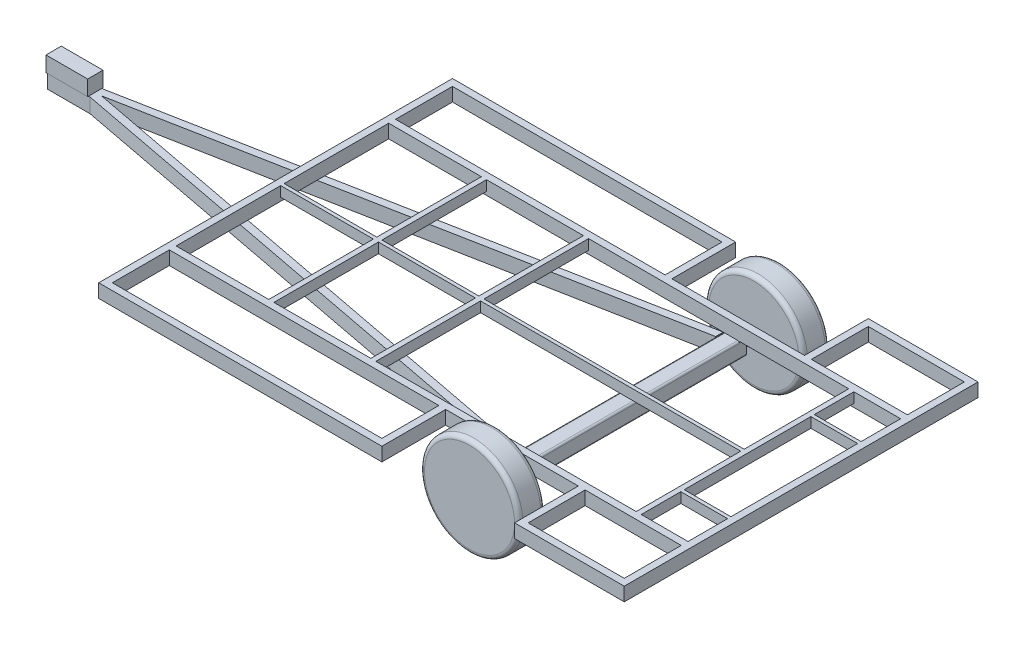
ISO-10303-21;
HEADER;
FILE_DESCRIPTION(('STEP AP214'),'2;1');
FILE_NAME('part.step','',(''),(''),'','','');
FILE_SCHEMA(('AUTOMOTIVE_DESIGN { 1 0 10303 214 1 1 1 1 }'));
ENDSEC;
DATA;
#1=APPLICATION_CONTEXT('core data for automotive mechanical design processes');
#2=APPLICATION_PROTOCOL_DEFINITION('international standard','automotive_design',2000,#1);
#3=PRODUCT_CONTEXT('',#1,'mechanical');
#4=PRODUCT('Part','Part','',(#3));
#5=PRODUCT_RELATED_PRODUCT_CATEGORY('part','',(#4));
#6=PRODUCT_DEFINITION_FORMATION('','',#4);
#7=PRODUCT_DEFINITION_CONTEXT('part definition',#1,'design');
#8=PRODUCT_DEFINITION('design','',#6,#7);
#9=PRODUCT_DEFINITION_SHAPE('','',#8);
#10=(LENGTH_UNIT() NAMED_UNIT(*) SI_UNIT(.MILLI.,.METRE.));
#11=(NAMED_UNIT(*) PLANE_ANGLE_UNIT() SI_UNIT($,.RADIAN.));
#12=(NAMED_UNIT(*) SI_UNIT($,.STERADIAN.) SOLID_ANGLE_UNIT());
#13=UNCERTAINTY_MEASURE_WITH_UNIT(LENGTH_MEASURE(1.E-05),#10,'distance_accuracy_value','');
#14=(GEOMETRIC_REPRESENTATION_CONTEXT(3) GLOBAL_UNCERTAINTY_ASSIGNED_CONTEXT((#13)) GLOBAL_UNIT_ASSIGNED_CONTEXT((#10,
#11,#12)) REPRESENTATION_CONTEXT('',''));
#15=CARTESIAN_POINT('',(0.,0.,0.));
#16=DIRECTION('',(0.,0.,1.));
#17=DIRECTION('',(1.,0.,0.));
#18=AXIS2_PLACEMENT_3D('',#15,#16,#17);
#19=CARTESIAN_POINT('',(0.,0.,0.));
#20=DIRECTION('',(0.,-1.,0.));
#21=DIRECTION('',(0.,0.,-1.));
#22=AXIS2_PLACEMENT_3D('',#19,#20,#21);
#23=PLANE('',#22);
#24=DIRECTION('',(0.,0.,-1.));
#25=VECTOR('',#24,1.);
#26=CARTESIAN_POINT('',(-1060.,0.,-1085.));
#27=LINE('',#26,#25);
#28=CARTESIAN_POINT('',(-1060.,0.,-1000.));
#29=VERTEX_POINT('',#28);
#30=CARTESIAN_POINT('',(-1060.,0.,-1080.));
#31=VERTEX_POINT('',#30);
#32=EDGE_CURVE('E12',#29,#31,#27,.T.);
#33=ORIENTED_EDGE('',*,*,#32,.F.);
#34=DIRECTION('',(-1.,0.,0.));
#35=VECTOR('',#34,1.);
#36=CARTESIAN_POINT('',(-1300.,0.,-1000.));
#37=LINE('',#36,#35);
#38=CARTESIAN_POINT('',(-1050.,0.,-1000.));
#39=VERTEX_POINT('',#38);
#40=EDGE_CURVE('E188',#39,#29,#37,.T.);
#41=ORIENTED_EDGE('',*,*,#40,.F.);
#42=DIRECTION('',(-0.98218358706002,0.,-0.187923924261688));
#43=VECTOR('',#42,1.);
#44=CARTESIAN_POINT('',(-1050.,0.,-1000.));
#45=LINE('',#44,#43);
#46=CARTESIAN_POINT('',(2007.5,0.,-415.));
#47=VERTEX_POINT('',#46);
#48=EDGE_CURVE('E186',#47,#39,#45,.T.);
#49=ORIENTED_EDGE('',*,*,#48,.F.);
#50=DIRECTION('',(0.,0.,1.));
#51=VECTOR('',#50,1.);
#52=CARTESIAN_POINT('',(2007.5,0.,-415.));
#53=LINE('',#52,#51);
#54=CARTESIAN_POINT('',(2007.5,0.,-460.));
#55=VERTEX_POINT('',#54);
#56=EDGE_CURVE('E154',#55,#47,#53,.T.);
#57=ORIENTED_EDGE('',*,*,#56,.F.);
#58=DIRECTION('',(0.98218358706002,0.,0.187923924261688));
#59=VECTOR('',#58,1.);
#60=CARTESIAN_POINT('',(2007.5,0.,-460.));
#61=LINE('',#60,#59);
#62=CARTESIAN_POINT('',(-1021.25427350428,0.,-1039.5));
#63=VERTEX_POINT('',#62);
#64=EDGE_CURVE('E183',#63,#55,#61,.T.);
#65=ORIENTED_EDGE('',*,*,#64,.F.);
#66=DIRECTION('',(0.,0.,1.));
#67=VECTOR('',#66,1.);
#68=CARTESIAN_POINT('',(-1021.25427350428,0.,-1039.5));
#69=LINE('',#68,#67);
#70=CARTESIAN_POINT('',(-1021.25427350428,0.,-1040.5));
#71=VERTEX_POINT('',#70);
#72=EDGE_CURVE('E181',#71,#63,#69,.T.);
#73=ORIENTED_EDGE('',*,*,#72,.F.);
#74=DIRECTION('',(-0.98218358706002,0.,0.187923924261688));
#75=VECTOR('',#74,1.);
#76=CARTESIAN_POINT('',(-1021.25427350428,0.,-1040.5));
#77=LINE('',#76,#75);
#78=CARTESIAN_POINT('',(2007.5,0.,-1620.));
#79=VERTEX_POINT('',#78);
#80=EDGE_CURVE('E179',#79,#71,#77,.T.);
#81=ORIENTED_EDGE('',*,*,#80,.F.);
#82=DIRECTION('',(0.,0.,1.));
#83=VECTOR('',#82,1.);
#84=CARTESIAN_POINT('',(2007.5,0.,-1620.));
#85=LINE('',#84,#83);
#86=CARTESIAN_POINT('',(2007.5,0.,-1665.));
#87=VERTEX_POINT('',#86);
#88=EDGE_CURVE('E177',#87,#79,#85,.T.);
#89=ORIENTED_EDGE('',*,*,#88,.F.);
#90=DIRECTION('',(0.98218358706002,0.,-0.187923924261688));
#91=VECTOR('',#90,1.);
#92=CARTESIAN_POINT('',(2007.5,0.,-1665.));
#93=LINE('',#92,#91);
#94=CARTESIAN_POINT('',(-1050.,0.,-1080.));
#95=VERTEX_POINT('',#94);
#96=EDGE_CURVE('E175',#95,#87,#93,.T.);
#97=ORIENTED_EDGE('',*,*,#96,.F.);
#98=DIRECTION('',(1.,0.,0.));
#99=VECTOR('',#98,1.);
#100=CARTESIAN_POINT('',(-1300.,0.,-1080.));
#101=LINE('',#100,#99);
#102=EDGE_CURVE('E170',#31,#95,#101,.T.);
#103=ORIENTED_EDGE('',*,*,#102,.F.);
#104=EDGE_LOOP('',(#33,#41,#49,#57,#65,#73,#81,#89,#97,#103));
#105=FACE_BOUND('',#104,.T.);
#106=ADVANCED_FACE('F46',(#105),#23,.F.);
#107=CARTESIAN_POINT('',(-1300.,-85.,-1000.));
#108=DIRECTION('',(1.,0.,0.));
#109=DIRECTION('',(0.,0.,-1.));
#110=AXIS2_PLACEMENT_3D('',#107,#108,#109);
#111=PLANE('',#110);
#112=DIRECTION('',(0.,0.,-1.));
#113=VECTOR('',#112,1.);
#114=CARTESIAN_POINT('',(-1300.,0.,-1000.));
#115=LINE('',#114,#113);
#116=CARTESIAN_POINT('',(-1300.,0.,-1000.));
#117=VERTEX_POINT('',#116);
#118=CARTESIAN_POINT('',(-1300.,0.,-1080.));
#119=VERTEX_POINT('',#118);
#120=EDGE_CURVE('E167',#117,#119,#115,.T.);
#121=ORIENTED_EDGE('',*,*,#120,.T.);
#122=DIRECTION('',(0.,1.,0.));
#123=VECTOR('',#122,1.);
#124=CARTESIAN_POINT('',(-1300.,-85.,-1080.));
#125=LINE('',#124,#123);
#126=CARTESIAN_POINT('',(-1300.,-85.,-1080.));
#127=VERTEX_POINT('',#126);
#128=EDGE_CURVE('E50',#127,#119,#125,.T.);
#129=ORIENTED_EDGE('',*,*,#128,.F.);
#130=DIRECTION('',(0.,0.,-1.));
#131=VECTOR('',#130,1.);
#132=CARTESIAN_POINT('',(-1300.,-85.,-1000.));
#133=LINE('',#132,#131);
#134=CARTESIAN_POINT('',(-1300.,-85.,-1000.));
#135=VERTEX_POINT('',#134);
#136=EDGE_CURVE('E190',#135,#127,#133,.T.);
#137=ORIENTED_EDGE('',*,*,#136,.F.);
#138=DIRECTION('',(0.,1.,0.));
#139=VECTOR('',#138,1.);
#140=CARTESIAN_POINT('',(-1300.,-85.,-1000.));
#141=LINE('',#140,#139);
#142=EDGE_CURVE('E163',#135,#117,#141,.T.);
#143=ORIENTED_EDGE('',*,*,#142,.T.);
#144=EDGE_LOOP('',(#121,#129,#137,#143));
#145=FACE_BOUND('',#144,.T.);
#146=ADVANCED_FACE('F48',(#145),#111,.F.);
#147=CARTESIAN_POINT('',(-1300.,-85.,-1080.));
#148=DIRECTION('',(0.,0.,1.));
#149=DIRECTION('',(1.,0.,0.));
#150=AXIS2_PLACEMENT_3D('',#147,#148,#149);
#151=PLANE('',#150);
#152=EDGE_CURVE('E172',#119,#31,#101,.T.);
#153=ORIENTED_EDGE('',*,*,#152,.T.);
#154=ORIENTED_EDGE('',*,*,#102,.T.);
#155=DIRECTION('',(0.,1.,0.));
#156=VECTOR('',#155,1.);
#157=CARTESIAN_POINT('',(-1050.,-85.,-1080.));
#158=LINE('',#157,#156);
#159=CARTESIAN_POINT('',(-1050.,-85.,-1080.));
#160=VERTEX_POINT('',#159);
#161=EDGE_CURVE('E205',#160,#95,#158,.T.);
#162=ORIENTED_EDGE('',*,*,#161,.F.);
#163=DIRECTION('',(1.,0.,0.));
#164=VECTOR('',#163,1.);
#165=CARTESIAN_POINT('',(-1300.,-85.,-1080.));
#166=LINE('',#165,#164);
#167=EDGE_CURVE('E117',#127,#160,#166,.T.);
#168=ORIENTED_EDGE('',*,*,#167,.F.);
#169=ORIENTED_EDGE('',*,*,#128,.T.);
#170=EDGE_LOOP('',(#153,#154,#162,#168,#169));
#171=FACE_BOUND('',#170,.T.);
#172=ADVANCED_FACE('F211',(#171),#151,.F.);
#173=CARTESIAN_POINT('',(2007.5,-85.,-1665.));
#174=DIRECTION('',(0.187923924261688,0.,0.98218358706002));
#175=DIRECTION('',(0.98218358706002,0.,-0.187923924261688));
#176=AXIS2_PLACEMENT_3D('',#173,#174,#175);
#177=PLANE('',#176);
#178=ORIENTED_EDGE('',*,*,#96,.T.);
#179=DIRECTION('',(0.,1.,0.));
#180=VECTOR('',#179,1.);
#181=CARTESIAN_POINT('',(2007.5,-85.,-1665.));
#182=LINE('',#181,#180);
#183=CARTESIAN_POINT('',(2007.5,-85.,-1665.));
#184=VERTEX_POINT('',#183);
#185=EDGE_CURVE('E203',#184,#87,#182,.T.);
#186=ORIENTED_EDGE('',*,*,#185,.F.);
#187=DIRECTION('',(0.98218358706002,0.,-0.187923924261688));
#188=VECTOR('',#187,1.);
#189=CARTESIAN_POINT('',(2007.5,-85.,-1665.));
#190=LINE('',#189,#188);
#191=EDGE_CURVE('E255',#160,#184,#190,.T.);
#192=ORIENTED_EDGE('',*,*,#191,.F.);
#193=ORIENTED_EDGE('',*,*,#161,.T.);
#194=EDGE_LOOP('',(#178,#186,#192,#193));
#195=FACE_BOUND('',#194,.T.);
#196=ADVANCED_FACE('F274',(#195),#177,.F.);
#197=CARTESIAN_POINT('',(2007.5,-85.,-1620.));
#198=DIRECTION('',(-1.,0.,0.));
#199=DIRECTION('',(0.,0.,1.));
#200=AXIS2_PLACEMENT_3D('',#197,#198,#199);
#201=PLANE('',#200);
#202=ORIENTED_EDGE('',*,*,#88,.T.);
#203=DIRECTION('',(0.,1.,0.));
#204=VECTOR('',#203,1.);
#205=CARTESIAN_POINT('',(2007.5,-85.,-1620.));
#206=LINE('',#205,#204);
#207=CARTESIAN_POINT('',(2007.5,-85.,-1620.));
#208=VERTEX_POINT('',#207);
#209=EDGE_CURVE('E200',#208,#79,#206,.T.);
#210=ORIENTED_EDGE('',*,*,#209,.F.);
#211=DIRECTION('',(0.,0.,1.));
#212=VECTOR('',#211,1.);
#213=CARTESIAN_POINT('',(2007.5,-85.,-1620.));
#214=LINE('',#213,#212);
#215=EDGE_CURVE('E257',#184,#208,#214,.T.);
#216=ORIENTED_EDGE('',*,*,#215,.F.);
#217=ORIENTED_EDGE('',*,*,#185,.T.);
#218=EDGE_LOOP('',(#202,#210,#216,#217));
#219=FACE_BOUND('',#218,.T.);
#220=ADVANCED_FACE('F279',(#219),#201,.F.);
#221=CARTESIAN_POINT('',(-1021.25427350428,-85.,-1040.5));
#222=DIRECTION('',(-0.187923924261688,0.,-0.98218358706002));
#223=DIRECTION('',(-0.98218358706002,0.,0.187923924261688));
#224=AXIS2_PLACEMENT_3D('',#221,#222,#223);
#225=PLANE('',#224);
#226=ORIENTED_EDGE('',*,*,#80,.T.);
#227=DIRECTION('',(0.,1.,0.));
#228=VECTOR('',#227,1.);
#229=CARTESIAN_POINT('',(-1021.25427350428,-85.,-1040.5));
#230=LINE('',#229,#228);
#231=CARTESIAN_POINT('',(-1021.25427350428,-85.,-1040.5));
#232=VERTEX_POINT('',#231);
#233=EDGE_CURVE('E197',#232,#71,#230,.T.);
#234=ORIENTED_EDGE('',*,*,#233,.F.);
#235=DIRECTION('',(-0.98218358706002,0.,0.187923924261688));
#236=VECTOR('',#235,1.);
#237=CARTESIAN_POINT('',(-1021.25427350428,-85.,-1040.5));
#238=LINE('',#237,#236);
#239=EDGE_CURVE('E259',#208,#232,#238,.T.);
#240=ORIENTED_EDGE('',*,*,#239,.F.);
#241=ORIENTED_EDGE('',*,*,#209,.T.);
#242=EDGE_LOOP('',(#226,#234,#240,#241));
#243=FACE_BOUND('',#242,.T.);
#244=ADVANCED_FACE('F282',(#243),#225,.F.);
#245=CARTESIAN_POINT('',(-1021.25427350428,-85.,-1039.5));
#246=DIRECTION('',(-1.,0.,0.));
#247=DIRECTION('',(0.,0.,1.));
#248=AXIS2_PLACEMENT_3D('',#245,#246,#247);
#249=PLANE('',#248);
#250=ORIENTED_EDGE('',*,*,#72,.T.);
#251=DIRECTION('',(0.,1.,0.));
#252=VECTOR('',#251,1.);
#253=CARTESIAN_POINT('',(-1021.25427350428,-85.,-1039.5));
#254=LINE('',#253,#252);
#255=CARTESIAN_POINT('',(-1021.25427350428,-85.,-1039.5));
#256=VERTEX_POINT('',#255);
#257=EDGE_CURVE('E194',#256,#63,#254,.T.);
#258=ORIENTED_EDGE('',*,*,#257,.F.);
#259=DIRECTION('',(0.,0.,1.));
#260=VECTOR('',#259,1.);
#261=CARTESIAN_POINT('',(-1021.25427350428,-85.,-1039.5));
#262=LINE('',#261,#260);
#263=EDGE_CURVE('E261',#232,#256,#262,.T.);
#264=ORIENTED_EDGE('',*,*,#263,.F.);
#265=ORIENTED_EDGE('',*,*,#233,.T.);
#266=EDGE_LOOP('',(#250,#258,#264,#265));
#267=FACE_BOUND('',#266,.T.);
#268=ADVANCED_FACE('F267',(#267),#249,.F.);
#269=CARTESIAN_POINT('',(2007.5,-85.,-460.));
#270=DIRECTION('',(-0.187923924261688,0.,0.98218358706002));
#271=DIRECTION('',(0.98218358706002,0.,0.187923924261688));
#272=AXIS2_PLACEMENT_3D('',#269,#270,#271);
#273=PLANE('',#272);
#274=ORIENTED_EDGE('',*,*,#64,.T.);
#275=DIRECTION('',(0.,1.,0.));
#276=VECTOR('',#275,1.);
#277=CARTESIAN_POINT('',(2007.5,-85.,-460.));
#278=LINE('',#277,#276);
#279=CARTESIAN_POINT('',(2007.5,-85.,-460.));
#280=VERTEX_POINT('',#279);
#281=EDGE_CURVE('E157',#280,#55,#278,.T.);
#282=ORIENTED_EDGE('',*,*,#281,.F.);
#283=DIRECTION('',(0.98218358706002,0.,0.187923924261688));
#284=VECTOR('',#283,1.);
#285=CARTESIAN_POINT('',(2007.5,-85.,-460.));
#286=LINE('',#285,#284);
#287=EDGE_CURVE('E145',#256,#280,#286,.T.);
#288=ORIENTED_EDGE('',*,*,#287,.F.);
#289=ORIENTED_EDGE('',*,*,#257,.T.);
#290=EDGE_LOOP('',(#274,#282,#288,#289));
#291=FACE_BOUND('',#290,.T.);
#292=ADVANCED_FACE('F271',(#291),#273,.F.);
#293=CARTESIAN_POINT('',(2007.5,-85.,-415.));
#294=DIRECTION('',(-1.,0.,0.));
#295=DIRECTION('',(0.,0.,1.));
#296=AXIS2_PLACEMENT_3D('',#293,#294,#295);
#297=PLANE('',#296);
#298=ORIENTED_EDGE('',*,*,#56,.T.);
#299=DIRECTION('',(0.,1.,0.));
#300=VECTOR('',#299,1.);
#301=CARTESIAN_POINT('',(2007.5,-85.,-415.));
#302=LINE('',#301,#300);
#303=CARTESIAN_POINT('',(2007.5,-85.,-415.));
#304=VERTEX_POINT('',#303);
#305=EDGE_CURVE('E151',#304,#47,#302,.T.);
#306=ORIENTED_EDGE('',*,*,#305,.F.);
#307=DIRECTION('',(0.,0.,1.));
#308=VECTOR('',#307,1.);
#309=CARTESIAN_POINT('',(2007.5,-85.,-415.));
#310=LINE('',#309,#308);
#311=EDGE_CURVE('E138',#280,#304,#310,.T.);
#312=ORIENTED_EDGE('',*,*,#311,.F.);
#313=ORIENTED_EDGE('',*,*,#281,.T.);
#314=EDGE_LOOP('',(#298,#306,#312,#313));
#315=FACE_BOUND('',#314,.T.);
#316=ADVANCED_FACE('F152',(#315),#297,.F.);
#317=CARTESIAN_POINT('',(-1050.,-85.,-1000.));
#318=DIRECTION('',(0.187923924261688,0.,-0.98218358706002));
#319=DIRECTION('',(-0.98218358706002,0.,-0.187923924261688));
#320=AXIS2_PLACEMENT_3D('',#317,#318,#319);
#321=PLANE('',#320);
#322=ORIENTED_EDGE('',*,*,#48,.T.);
#323=DIRECTION('',(0.,1.,0.));
#324=VECTOR('',#323,1.);
#325=CARTESIAN_POINT('',(-1050.,-85.,-1000.));
#326=LINE('',#325,#324);
#327=CARTESIAN_POINT('',(-1050.,-85.,-1000.));
#328=VERTEX_POINT('',#327);
#329=EDGE_CURVE('E158',#328,#39,#326,.T.);
#330=ORIENTED_EDGE('',*,*,#329,.F.);
#331=DIRECTION('',(-0.98218358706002,0.,-0.187923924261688));
#332=VECTOR('',#331,1.);
#333=CARTESIAN_POINT('',(-1050.,-85.,-1000.));
#334=LINE('',#333,#332);
#335=EDGE_CURVE('E142',#304,#328,#334,.T.);
#336=ORIENTED_EDGE('',*,*,#335,.F.);
#337=ORIENTED_EDGE('',*,*,#305,.T.);
#338=EDGE_LOOP('',(#322,#330,#336,#337));
#339=FACE_BOUND('',#338,.T.);
#340=ADVANCED_FACE('F160',(#339),#321,.F.);
#341=CARTESIAN_POINT('',(-1300.,-85.,-1000.));
#342=DIRECTION('',(0.,0.,-1.));
#343=DIRECTION('',(-1.,0.,0.));
#344=AXIS2_PLACEMENT_3D('',#341,#342,#343);
#345=PLANE('',#344);
#346=ORIENTED_EDGE('',*,*,#40,.T.);
#347=EDGE_CURVE('E109',#29,#117,#37,.T.);
#348=ORIENTED_EDGE('',*,*,#347,.T.);
#349=ORIENTED_EDGE('',*,*,#142,.F.);
#350=DIRECTION('',(-1.,0.,0.));
#351=VECTOR('',#350,1.);
#352=CARTESIAN_POINT('',(-1300.,-85.,-1000.));
#353=LINE('',#352,#351);
#354=EDGE_CURVE('E71',#328,#135,#353,.T.);
#355=ORIENTED_EDGE('',*,*,#354,.F.);
#356=ORIENTED_EDGE('',*,*,#329,.T.);
#357=EDGE_LOOP('',(#346,#348,#349,#355,#356));
#358=FACE_BOUND('',#357,.T.);
#359=ADVANCED_FACE('F272',(#358),#345,.F.);
#360=CARTESIAN_POINT('',(0.,-85.,0.));
#361=DIRECTION('',(0.,-1.,0.));
#362=DIRECTION('',(0.,0.,-1.));
#363=AXIS2_PLACEMENT_3D('',#360,#361,#362);
#364=PLANE('',#363);
#365=ORIENTED_EDGE('',*,*,#136,.T.);
#366=ORIENTED_EDGE('',*,*,#167,.T.);
#367=ORIENTED_EDGE('',*,*,#191,.T.);
#368=ORIENTED_EDGE('',*,*,#215,.T.);
#369=ORIENTED_EDGE('',*,*,#239,.T.);
#370=ORIENTED_EDGE('',*,*,#263,.T.);
#371=ORIENTED_EDGE('',*,*,#287,.T.);
#372=ORIENTED_EDGE('',*,*,#311,.T.);
#373=ORIENTED_EDGE('',*,*,#335,.T.);
#374=ORIENTED_EDGE('',*,*,#354,.T.);
#375=EDGE_LOOP('',(#365,#366,#367,#368,#369,#370,#371,#372,#373,#374));
#376=FACE_BOUND('',#375,.T.);
#377=ADVANCED_FACE('F140',(#376),#364,.T.);
#378=CARTESIAN_POINT('',(-1305.,90.,-1085.));
#379=DIRECTION('',(1.,0.,0.));
#380=DIRECTION('',(0.,0.,-1.));
#381=AXIS2_PLACEMENT_3D('',#378,#379,#380);
#382=PLANE('',#381);
#383=DIRECTION('',(0.,0.,1.));
#384=VECTOR('',#383,1.);
#385=CARTESIAN_POINT('',(-1305.,0.,-1085.));
#386=LINE('',#385,#384);
#387=CARTESIAN_POINT('',(-1305.,0.,-1085.));
#388=VERTEX_POINT('',#387);
#389=CARTESIAN_POINT('',(-1305.,0.,-995.));
#390=VERTEX_POINT('',#389);
#391=EDGE_CURVE('E450',#388,#390,#386,.T.);
#392=ORIENTED_EDGE('',*,*,#391,.T.);
#393=DIRECTION('',(0.,-1.,0.));
#394=VECTOR('',#393,1.);
#395=CARTESIAN_POINT('',(-1305.,90.,-995.));
#396=LINE('',#395,#394);
#397=CARTESIAN_POINT('',(-1305.,90.,-995.));
#398=VERTEX_POINT('',#397);
#399=EDGE_CURVE('E171',#398,#390,#396,.T.);
#400=ORIENTED_EDGE('',*,*,#399,.F.);
#401=DIRECTION('',(0.,0.,1.));
#402=VECTOR('',#401,1.);
#403=CARTESIAN_POINT('',(-1305.,90.,-1085.));
#404=LINE('',#403,#402);
#405=CARTESIAN_POINT('',(-1305.,90.,-1085.));
#406=VERTEX_POINT('',#405);
#407=EDGE_CURVE('E239',#406,#398,#404,.T.);
#408=ORIENTED_EDGE('',*,*,#407,.F.);
#409=DIRECTION('',(0.,-1.,0.));
#410=VECTOR('',#409,1.);
#411=CARTESIAN_POINT('',(-1305.,90.,-1085.));
#412=LINE('',#411,#410);
#413=EDGE_CURVE('E244',#406,#388,#412,.T.);
#414=ORIENTED_EDGE('',*,*,#413,.T.);
#415=EDGE_LOOP('',(#392,#400,#408,#414));
#416=FACE_BOUND('',#415,.T.);
#417=ADVANCED_FACE('F330',(#416),#382,.F.);
#418=CARTESIAN_POINT('',(-1305.,90.,-995.));
#419=DIRECTION('',(0.,0.,-1.));
#420=DIRECTION('',(-1.,0.,0.));
#421=AXIS2_PLACEMENT_3D('',#418,#419,#420);
#422=PLANE('',#421);
#423=DIRECTION('',(1.,0.,0.));
#424=VECTOR('',#423,1.);
#425=CARTESIAN_POINT('',(-1305.,0.,-995.));
#426=LINE('',#425,#424);
#427=CARTESIAN_POINT('',(-1060.,0.,-995.));
#428=VERTEX_POINT('',#427);
#429=EDGE_CURVE('E229',#390,#428,#426,.T.);
#430=ORIENTED_EDGE('',*,*,#429,.T.);
#431=DIRECTION('',(0.,-1.,0.));
#432=VECTOR('',#431,1.);
#433=CARTESIAN_POINT('',(-1060.,90.,-995.));
#434=LINE('',#433,#432);
#435=CARTESIAN_POINT('',(-1060.,90.,-995.));
#436=VERTEX_POINT('',#435);
#437=EDGE_CURVE('E237',#436,#428,#434,.T.);
#438=ORIENTED_EDGE('',*,*,#437,.F.);
#439=DIRECTION('',(1.,0.,0.));
#440=VECTOR('',#439,1.);
#441=CARTESIAN_POINT('',(-1305.,90.,-995.));
#442=LINE('',#441,#440);
#443=EDGE_CURVE('E442',#398,#436,#442,.T.);
#444=ORIENTED_EDGE('',*,*,#443,.F.);
#445=ORIENTED_EDGE('',*,*,#399,.T.);
#446=EDGE_LOOP('',(#430,#438,#444,#445));
#447=FACE_BOUND('',#446,.T.);
#448=ADVANCED_FACE('F335',(#447),#422,.F.);
#449=CARTESIAN_POINT('',(-1060.,90.,-1085.));
#450=DIRECTION('',(-1.,0.,0.));
#451=DIRECTION('',(0.,0.,1.));
#452=AXIS2_PLACEMENT_3D('',#449,#450,#451);
#453=PLANE('',#452);
#454=EDGE_CURVE('E56',#428,#29,#27,.T.);
#455=ORIENTED_EDGE('',*,*,#454,.T.);
#456=ORIENTED_EDGE('',*,*,#32,.T.);
#457=CARTESIAN_POINT('',(-1060.,0.,-1085.));
#458=VERTEX_POINT('',#457);
#459=EDGE_CURVE('E57',#31,#458,#27,.T.);
#460=ORIENTED_EDGE('',*,*,#459,.T.);
#461=DIRECTION('',(0.,-1.,0.));
#462=VECTOR('',#461,1.);
#463=CARTESIAN_POINT('',(-1060.,90.,-1085.));
#464=LINE('',#463,#462);
#465=CARTESIAN_POINT('',(-1060.,90.,-1085.));
#466=VERTEX_POINT('',#465);
#467=EDGE_CURVE('E247',#466,#458,#464,.T.);
#468=ORIENTED_EDGE('',*,*,#467,.F.);
#469=DIRECTION('',(0.,0.,-1.));
#470=VECTOR('',#469,1.);
#471=CARTESIAN_POINT('',(-1060.,90.,-1085.));
#472=LINE('',#471,#470);
#473=EDGE_CURVE('E459',#436,#466,#472,.T.);
#474=ORIENTED_EDGE('',*,*,#473,.F.);
#475=ORIENTED_EDGE('',*,*,#437,.T.);
#476=EDGE_LOOP('',(#455,#456,#460,#468,#474,#475));
#477=FACE_BOUND('',#476,.T.);
#478=ADVANCED_FACE('F231',(#477),#453,.F.);
#479=CARTESIAN_POINT('',(-1305.,90.,-1085.));
#480=DIRECTION('',(0.,0.,1.));
#481=DIRECTION('',(1.,0.,0.));
#482=AXIS2_PLACEMENT_3D('',#479,#480,#481);
#483=PLANE('',#482);
#484=DIRECTION('',(-1.,0.,0.));
#485=VECTOR('',#484,1.);
#486=CARTESIAN_POINT('',(-1305.,0.,-1085.));
#487=LINE('',#486,#485);
#488=EDGE_CURVE('E224',#458,#388,#487,.T.);
#489=ORIENTED_EDGE('',*,*,#488,.T.);
#490=ORIENTED_EDGE('',*,*,#413,.F.);
#491=DIRECTION('',(-1.,0.,0.));
#492=VECTOR('',#491,1.);
#493=CARTESIAN_POINT('',(-1305.,90.,-1085.));
#494=LINE('',#493,#492);
#495=EDGE_CURVE('E248',#466,#406,#494,.T.);
#496=ORIENTED_EDGE('',*,*,#495,.F.);
#497=ORIENTED_EDGE('',*,*,#467,.T.);
#498=EDGE_LOOP('',(#489,#490,#496,#497));
#499=FACE_BOUND('',#498,.T.);
#500=ADVANCED_FACE('F349',(#499),#483,.F.);
#501=CARTESIAN_POINT('',(0.,90.,0.));
#502=DIRECTION('',(0.,1.,0.));
#503=DIRECTION('',(0.,0.,1.));
#504=AXIS2_PLACEMENT_3D('',#501,#502,#503);
#505=PLANE('',#504);
#506=ORIENTED_EDGE('',*,*,#407,.T.);
#507=ORIENTED_EDGE('',*,*,#443,.T.);
#508=ORIENTED_EDGE('',*,*,#473,.T.);
#509=ORIENTED_EDGE('',*,*,#495,.T.);
#510=EDGE_LOOP('',(#506,#507,#508,#509));
#511=FACE_BOUND('',#510,.T.);
#512=ADVANCED_FACE('F356',(#511),#505,.T.);
#513=CARTESIAN_POINT('',(0.,0.,0.));
#514=DIRECTION('',(0.,1.,0.));
#515=DIRECTION('',(0.,0.,1.));
#516=AXIS2_PLACEMENT_3D('',#513,#514,#515);
#517=PLANE('',#516);
#518=ORIENTED_EDGE('',*,*,#347,.F.);
#519=ORIENTED_EDGE('',*,*,#454,.F.);
#520=ORIENTED_EDGE('',*,*,#429,.F.);
#521=ORIENTED_EDGE('',*,*,#391,.F.);
#522=ORIENTED_EDGE('',*,*,#488,.F.);
#523=ORIENTED_EDGE('',*,*,#459,.F.);
#524=ORIENTED_EDGE('',*,*,#152,.F.);
#525=ORIENTED_EDGE('',*,*,#120,.F.);
#526=EDGE_LOOP('',(#518,#519,#520,#521,#522,#523,#524,#525));
#527=FACE_BOUND('',#526,.T.);
#528=ADVANCED_FACE('F218',(#527),#517,.F.);
#529=CLOSED_SHELL('',(#106,#146,#172,#196,#220,#244,#268,#292,#316,#340,#359,#377,#417,#448,
#478,#500,#512,#528));
#530=MANIFOLD_SOLID_BREP('B2',#529);
#531=CARTESIAN_POINT('',(0.,0.,0.));
#532=DIRECTION('',(0.,-1.,0.));
#533=DIRECTION('',(0.,0.,-1.));
#534=AXIS2_PLACEMENT_3D('',#531,#532,#533);
#535=PLANE('',#534);
#536=DIRECTION('',(0.,0.,1.));
#537=VECTOR('',#536,1.);
#538=CARTESIAN_POINT('',(2007.5,0.,-1705.));
#539=LINE('',#538,#537);
#540=CARTESIAN_POINT('',(2007.5,0.,-415.));
#541=VERTEX_POINT('',#540);
#542=CARTESIAN_POINT('',(2007.5,0.,-375.));
#543=VERTEX_POINT('',#542);
#544=EDGE_CURVE('E943',#541,#543,#539,.T.);
#545=ORIENTED_EDGE('',*,*,#544,.T.);
#546=DIRECTION('',(1.,0.,0.));
#547=VECTOR('',#546,1.);
#548=CARTESIAN_POINT('',(40.,0.,-375.));
#549=LINE('',#548,#547);
#550=CARTESIAN_POINT('',(1665.,0.,-375.));
#551=VERTEX_POINT('',#550);
#552=EDGE_CURVE('E955',#551,#543,#549,.T.);
#553=ORIENTED_EDGE('',*,*,#552,.F.);
#554=DIRECTION('',(0.,0.,1.));
#555=VECTOR('',#554,1.);
#556=CARTESIAN_POINT('',(1665.,0.,-375.));
#557=LINE('',#556,#555);
#558=CARTESIAN_POINT('',(1665.,0.,0.));
#559=VERTEX_POINT('',#558);
#560=EDGE_CURVE('E1014',#551,#559,#557,.T.);
#561=ORIENTED_EDGE('',*,*,#560,.T.);
#562=DIRECTION('',(1.,0.,0.));
#563=VECTOR('',#562,1.);
#564=CARTESIAN_POINT('',(0.,0.,0.));
#565=LINE('',#564,#563);
#566=CARTESIAN_POINT('',(0.,0.,0.));
#567=VERTEX_POINT('',#566);
#568=EDGE_CURVE('E1802',#567,#559,#565,.T.);
#569=ORIENTED_EDGE('',*,*,#568,.F.);
#570=DIRECTION('',(0.,0.,1.));
#571=VECTOR('',#570,1.);
#572=CARTESIAN_POINT('',(0.,0.,0.));
#573=LINE('',#572,#571);
#574=CARTESIAN_POINT('',(0.,0.,-2080.));
#575=VERTEX_POINT('',#574);
#576=EDGE_CURVE('E1784',#575,#567,#573,.T.);
#577=ORIENTED_EDGE('',*,*,#576,.F.);
#578=DIRECTION('',(-1.,0.,0.));
#579=VECTOR('',#578,1.);
#580=CARTESIAN_POINT('',(0.,0.,-2080.));
#581=LINE('',#580,#579);
#582=CARTESIAN_POINT('',(1665.,0.,-2080.));
#583=VERTEX_POINT('',#582);
#584=EDGE_CURVE('E1807',#583,#575,#581,.T.);
#585=ORIENTED_EDGE('',*,*,#584,.F.);
#586=DIRECTION('',(0.,0.,1.));
#587=VECTOR('',#586,1.);
#588=CARTESIAN_POINT('',(1665.,0.,-2040.));
#589=LINE('',#588,#587);
#590=CARTESIAN_POINT('',(1665.,0.,-1705.));
#591=VERTEX_POINT('',#590);
#592=EDGE_CURVE('E1107',#583,#591,#589,.T.);
#593=ORIENTED_EDGE('',*,*,#592,.T.);
#594=DIRECTION('',(1.,0.,0.));
#595=VECTOR('',#594,1.);
#596=CARTESIAN_POINT('',(40.,0.,-1705.));
#597=LINE('',#596,#595);
#598=CARTESIAN_POINT('',(2007.5,0.,-1705.));
#599=VERTEX_POINT('',#598);
#600=EDGE_CURVE('E1039',#591,#599,#597,.T.);
#601=ORIENTED_EDGE('',*,*,#600,.T.);
#602=CARTESIAN_POINT('',(2007.5,0.,-1665.));
#603=VERTEX_POINT('',#602);
#604=EDGE_CURVE('E958',#599,#603,#539,.T.);
#605=ORIENTED_EDGE('',*,*,#604,.T.);
#606=DIRECTION('',(1.,0.,0.));
#607=VECTOR('',#606,1.);
#608=CARTESIAN_POINT('',(40.,0.,-1665.));
#609=LINE('',#608,#607);
#610=CARTESIAN_POINT('',(40.0000000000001,0.,-1665.));
#611=VERTEX_POINT('',#610);
#612=EDGE_CURVE('E1043',#611,#603,#609,.T.);
#613=ORIENTED_EDGE('',*,*,#612,.F.);
#614=DIRECTION('',(0.,0.,1.));
#615=VECTOR('',#614,1.);
#616=CARTESIAN_POINT('',(40.,0.,-2040.));
#617=LINE('',#616,#615);
#618=CARTESIAN_POINT('',(40.0000000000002,0.,-415.));
#619=VERTEX_POINT('',#618);
#620=EDGE_CURVE('E1678',#611,#619,#617,.T.);
#621=ORIENTED_EDGE('',*,*,#620,.T.);
#622=DIRECTION('',(1.,0.,0.));
#623=VECTOR('',#622,1.);
#624=CARTESIAN_POINT('',(40.,0.,-415.));
#625=LINE('',#624,#623);
#626=EDGE_CURVE('E957',#619,#541,#625,.T.);
#627=ORIENTED_EDGE('',*,*,#626,.T.);
#628=EDGE_LOOP('',(#545,#553,#561,#569,#577,#585,#593,#601,#605,#613,#621,#627));
#629=FACE_BOUND('',#628,.T.);
#630=CARTESIAN_POINT('',(40.0000000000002,0.,-375.));
#631=VERTEX_POINT('',#630);
#632=CARTESIAN_POINT('',(1625.,0.,-375.));
#633=VERTEX_POINT('',#632);
#634=EDGE_CURVE('E964',#631,#633,#549,.T.);
#635=ORIENTED_EDGE('',*,*,#634,.F.);
#636=CARTESIAN_POINT('',(40.0000000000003,0.,-40.));
#637=VERTEX_POINT('',#636);
#638=EDGE_CURVE('E1009',#631,#637,#617,.T.);
#639=ORIENTED_EDGE('',*,*,#638,.T.);
#640=DIRECTION('',(1.,0.,0.));
#641=VECTOR('',#640,1.);
#642=CARTESIAN_POINT('',(40.0000000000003,0.,-40.));
#643=LINE('',#642,#641);
#644=CARTESIAN_POINT('',(1625.,0.,-40.));
#645=VERTEX_POINT('',#644);
#646=EDGE_CURVE('E1771',#637,#645,#643,.T.);
#647=ORIENTED_EDGE('',*,*,#646,.T.);
#648=DIRECTION('',(0.,0.,1.));
#649=VECTOR('',#648,1.);
#650=CARTESIAN_POINT('',(1625.,0.,-375.));
#651=LINE('',#650,#649);
#652=EDGE_CURVE('E1010',#633,#645,#651,.T.);
#653=ORIENTED_EDGE('',*,*,#652,.F.);
#654=EDGE_LOOP('',(#635,#639,#647,#653));
#655=FACE_BOUND('',#654,.T.);
#656=CARTESIAN_POINT('',(40.,0.,-2040.));
#657=VERTEX_POINT('',#656);
#658=CARTESIAN_POINT('',(40.,0.,-1705.));
#659=VERTEX_POINT('',#658);
#660=EDGE_CURVE('E1680',#657,#659,#617,.T.);
#661=ORIENTED_EDGE('',*,*,#660,.T.);
#662=CARTESIAN_POINT('',(1625.,0.,-1705.));
#663=VERTEX_POINT('',#662);
#664=EDGE_CURVE('E1049',#659,#663,#597,.T.);
#665=ORIENTED_EDGE('',*,*,#664,.T.);
#666=DIRECTION('',(0.,0.,1.));
#667=VECTOR('',#666,1.);
#668=CARTESIAN_POINT('',(1625.,0.,-2040.));
#669=LINE('',#668,#667);
#670=CARTESIAN_POINT('',(1625.,0.,-2040.));
#671=VERTEX_POINT('',#670);
#672=EDGE_CURVE('E1109',#671,#663,#669,.T.);
#673=ORIENTED_EDGE('',*,*,#672,.F.);
#674=DIRECTION('',(-1.,0.,0.));
#675=VECTOR('',#674,1.);
#676=CARTESIAN_POINT('',(40.,0.,-2040.));
#677=LINE('',#676,#675);
#678=EDGE_CURVE('E1161',#671,#657,#677,.T.);
#679=ORIENTED_EDGE('',*,*,#678,.T.);
#680=EDGE_LOOP('',(#661,#665,#673,#679));
#681=FACE_BOUND('',#680,.T.);
#682=ADVANCED_FACE('F465',(#629,#655,#681),#535,.T.);
#683=CARTESIAN_POINT('',(0.,80.,0.));
#684=DIRECTION('',(0.,-1.,0.));
#685=DIRECTION('',(0.,0.,-1.));
#686=AXIS2_PLACEMENT_3D('',#683,#684,#685);
#687=PLANE('',#686);
#688=DIRECTION('',(0.,0.,1.));
#689=VECTOR('',#688,1.);
#690=CARTESIAN_POINT('',(40.,80.,-2040.));
#691=LINE('',#690,#689);
#692=CARTESIAN_POINT('',(40.,80.,-1030.));
#693=VERTEX_POINT('',#692);
#694=CARTESIAN_POINT('',(40.,80.,-415.));
#695=VERTEX_POINT('',#694);
#696=EDGE_CURVE('E2572',#693,#695,#691,.T.);
#697=ORIENTED_EDGE('',*,*,#696,.F.);
#698=DIRECTION('',(1.,0.,0.));
#699=VECTOR('',#698,1.);
#700=CARTESIAN_POINT('',(40.,80.,-1030.));
#701=LINE('',#700,#699);
#702=CARTESIAN_POINT('',(585.,80.,-1030.));
#703=VERTEX_POINT('',#702);
#704=EDGE_CURVE('E1337',#693,#703,#701,.T.);
#705=ORIENTED_EDGE('',*,*,#704,.T.);
#706=DIRECTION('',(0.,0.,1.));
#707=VECTOR('',#706,1.);
#708=CARTESIAN_POINT('',(585.,80.,-1030.));
#709=LINE('',#708,#707);
#710=CARTESIAN_POINT('',(585.,80.,-415.));
#711=VERTEX_POINT('',#710);
#712=EDGE_CURVE('E1496',#703,#711,#709,.T.);
#713=ORIENTED_EDGE('',*,*,#712,.T.);
#714=DIRECTION('',(1.,0.,0.));
#715=VECTOR('',#714,1.);
#716=CARTESIAN_POINT('',(40.,80.,-415.));
#717=LINE('',#716,#715);
#718=EDGE_CURVE('E983',#695,#711,#717,.T.);
#719=ORIENTED_EDGE('',*,*,#718,.F.);
#720=EDGE_LOOP('',(#697,#705,#713,#719));
#721=FACE_BOUND('',#720,.T.);
#722=DIRECTION('',(0.,0.,-1.));
#723=VECTOR('',#722,1.);
#724=CARTESIAN_POINT('',(3050.,80.,-2040.));
#725=LINE('',#724,#723);
#726=CARTESIAN_POINT('',(3050.,80.,-667.5));
#727=VERTEX_POINT('',#726);
#728=CARTESIAN_POINT('',(3050.,80.,-1412.5));
#729=VERTEX_POINT('',#728);
#730=EDGE_CURVE('E1179',#727,#729,#725,.T.);
#731=ORIENTED_EDGE('',*,*,#730,.F.);
#732=DIRECTION('',(-1.,0.,0.));
#733=VECTOR('',#732,1.);
#734=CARTESIAN_POINT('',(3050.,80.,-667.5));
#735=LINE('',#734,#733);
#736=CARTESIAN_POINT('',(2775.,80.,-667.5));
#737=VERTEX_POINT('',#736);
#738=EDGE_CURVE('E1517',#727,#737,#735,.T.);
#739=ORIENTED_EDGE('',*,*,#738,.T.);
#740=DIRECTION('',(0.,0.,-1.));
#741=VECTOR('',#740,1.);
#742=CARTESIAN_POINT('',(2775.,80.,-1412.5));
#743=LINE('',#742,#741);
#744=CARTESIAN_POINT('',(2775.,80.,-1412.5));
#745=VERTEX_POINT('',#744);
#746=EDGE_CURVE('E1198',#737,#745,#743,.T.);
#747=ORIENTED_EDGE('',*,*,#746,.T.);
#748=DIRECTION('',(1.,0.,0.));
#749=VECTOR('',#748,1.);
#750=CARTESIAN_POINT('',(3050.,80.,-1412.5));
#751=LINE('',#750,#749);
#752=EDGE_CURVE('E1195',#745,#729,#751,.T.);
#753=ORIENTED_EDGE('',*,*,#752,.T.);
#754=EDGE_LOOP('',(#731,#739,#747,#753));
#755=FACE_BOUND('',#754,.T.);
#756=CARTESIAN_POINT('',(3050.,80.,-1432.5));
#757=VERTEX_POINT('',#756);
#758=CARTESIAN_POINT('',(3050.,80.,-1665.));
#759=VERTEX_POINT('',#758);
#760=EDGE_CURVE('E1175',#757,#759,#725,.T.);
#761=ORIENTED_EDGE('',*,*,#760,.F.);
#762=DIRECTION('',(-1.,0.,0.));
#763=VECTOR('',#762,1.);
#764=CARTESIAN_POINT('',(2775.,80.,-1432.5));
#765=LINE('',#764,#763);
#766=CARTESIAN_POINT('',(2775.,80.,-1432.5));
#767=VERTEX_POINT('',#766);
#768=EDGE_CURVE('E1202',#757,#767,#765,.T.);
#769=ORIENTED_EDGE('',*,*,#768,.T.);
#770=DIRECTION('',(0.,0.,-1.));
#771=VECTOR('',#770,1.);
#772=CARTESIAN_POINT('',(2775.,80.,-1665.));
#773=LINE('',#772,#771);
#774=CARTESIAN_POINT('',(2775.,80.,-1665.));
#775=VERTEX_POINT('',#774);
#776=EDGE_CURVE('E1381',#767,#775,#773,.T.);
#777=ORIENTED_EDGE('',*,*,#776,.T.);
#778=DIRECTION('',(1.,0.,0.));
#779=VECTOR('',#778,1.);
#780=CARTESIAN_POINT('',(40.,80.,-1665.));
#781=LINE('',#780,#779);
#782=EDGE_CURVE('E1055',#775,#759,#781,.T.);
#783=ORIENTED_EDGE('',*,*,#782,.T.);
#784=EDGE_LOOP('',(#761,#769,#777,#783));
#785=FACE_BOUND('',#784,.T.);
#786=CARTESIAN_POINT('',(2775.,80.,-415.));
#787=VERTEX_POINT('',#786);
#788=CARTESIAN_POINT('',(3050.,80.,-415.));
#789=VERTEX_POINT('',#788);
#790=EDGE_CURVE('E996',#787,#789,#717,.T.);
#791=ORIENTED_EDGE('',*,*,#790,.F.);
#792=DIRECTION('',(0.,0.,-1.));
#793=VECTOR('',#792,1.);
#794=CARTESIAN_POINT('',(2775.,80.,-415.));
#795=LINE('',#794,#793);
#796=CARTESIAN_POINT('',(2775.,80.,-647.5));
#797=VERTEX_POINT('',#796);
#798=EDGE_CURVE('E1512',#787,#797,#795,.T.);
#799=ORIENTED_EDGE('',*,*,#798,.T.);
#800=DIRECTION('',(1.,0.,0.));
#801=VECTOR('',#800,1.);
#802=CARTESIAN_POINT('',(2775.,80.,-647.5));
#803=LINE('',#802,#801);
#804=CARTESIAN_POINT('',(3050.,80.,-647.5));
#805=VERTEX_POINT('',#804);
#806=EDGE_CURVE('E1514',#797,#805,#803,.T.);
#807=ORIENTED_EDGE('',*,*,#806,.T.);
#808=EDGE_CURVE('E1178',#789,#805,#725,.T.);
#809=ORIENTED_EDGE('',*,*,#808,.F.);
#810=EDGE_LOOP('',(#791,#799,#807,#809));
#811=FACE_BOUND('',#810,.T.);
#812=CARTESIAN_POINT('',(1215.,80.,-415.));
#813=VERTEX_POINT('',#812);
#814=CARTESIAN_POINT('',(2745.,80.,-415.));
#815=VERTEX_POINT('',#814);
#816=EDGE_CURVE('E1694',#813,#815,#717,.T.);
#817=ORIENTED_EDGE('',*,*,#816,.F.);
#818=DIRECTION('',(0.,0.,-1.));
#819=VECTOR('',#818,1.);
#820=CARTESIAN_POINT('',(1215.,80.,-415.));
#821=LINE('',#820,#819);
#822=CARTESIAN_POINT('',(1215.,80.,-1030.));
#823=VERTEX_POINT('',#822);
#824=EDGE_CURVE('E1505',#813,#823,#821,.T.);
#825=ORIENTED_EDGE('',*,*,#824,.T.);
#826=DIRECTION('',(1.,0.,0.));
#827=VECTOR('',#826,1.);
#828=CARTESIAN_POINT('',(1215.,80.,-1030.));
#829=LINE('',#828,#827);
#830=CARTESIAN_POINT('',(2745.,80.,-1030.));
#831=VERTEX_POINT('',#830);
#832=EDGE_CURVE('E1507',#823,#831,#829,.T.);
#833=ORIENTED_EDGE('',*,*,#832,.T.);
#834=DIRECTION('',(0.,0.,1.));
#835=VECTOR('',#834,1.);
#836=CARTESIAN_POINT('',(2745.,80.,-1030.));
#837=LINE('',#836,#835);
#838=EDGE_CURVE('E1509',#831,#815,#837,.T.);
#839=ORIENTED_EDGE('',*,*,#838,.T.);
#840=EDGE_LOOP('',(#817,#825,#833,#839));
#841=FACE_BOUND('',#840,.T.);
#842=CARTESIAN_POINT('',(615.,80.,-415.));
#843=VERTEX_POINT('',#842);
#844=CARTESIAN_POINT('',(1185.,80.,-415.));
#845=VERTEX_POINT('',#844);
#846=EDGE_CURVE('E1693',#843,#845,#717,.T.);
#847=ORIENTED_EDGE('',*,*,#846,.F.);
#848=DIRECTION('',(0.,0.,-1.));
#849=VECTOR('',#848,1.);
#850=CARTESIAN_POINT('',(615.,80.,-415.));
#851=LINE('',#850,#849);
#852=CARTESIAN_POINT('',(615.,80.,-1030.));
#853=VERTEX_POINT('',#852);
#854=EDGE_CURVE('E1498',#843,#853,#851,.T.);
#855=ORIENTED_EDGE('',*,*,#854,.T.);
#856=DIRECTION('',(1.,0.,0.));
#857=VECTOR('',#856,1.);
#858=CARTESIAN_POINT('',(615.,80.,-1030.));
#859=LINE('',#858,#857);
#860=CARTESIAN_POINT('',(1185.,80.,-1030.));
#861=VERTEX_POINT('',#860);
#862=EDGE_CURVE('E1500',#853,#861,#859,.T.);
#863=ORIENTED_EDGE('',*,*,#862,.T.);
#864=DIRECTION('',(0.,0.,1.));
#865=VECTOR('',#864,1.);
#866=CARTESIAN_POINT('',(1185.,80.,-1030.));
#867=LINE('',#866,#865);
#868=EDGE_CURVE('E1502',#861,#845,#867,.T.);
#869=ORIENTED_EDGE('',*,*,#868,.T.);
#870=EDGE_LOOP('',(#847,#855,#863,#869));
#871=FACE_BOUND('',#870,.T.);
#872=CARTESIAN_POINT('',(1215.,80.,-1665.));
#873=VERTEX_POINT('',#872);
#874=CARTESIAN_POINT('',(2745.,80.,-1665.));
#875=VERTEX_POINT('',#874);
#876=EDGE_CURVE('E1391',#873,#875,#781,.T.);
#877=ORIENTED_EDGE('',*,*,#876,.T.);
#878=DIRECTION('',(0.,0.,1.));
#879=VECTOR('',#878,1.);
#880=CARTESIAN_POINT('',(2745.,80.,-1050.));
#881=LINE('',#880,#879);
#882=CARTESIAN_POINT('',(2745.,80.,-1050.));
#883=VERTEX_POINT('',#882);
#884=EDGE_CURVE('E1522',#875,#883,#881,.T.);
#885=ORIENTED_EDGE('',*,*,#884,.T.);
#886=DIRECTION('',(-1.,0.,0.));
#887=VECTOR('',#886,1.);
#888=CARTESIAN_POINT('',(1215.,80.,-1050.));
#889=LINE('',#888,#887);
#890=CARTESIAN_POINT('',(1215.,80.,-1050.));
#891=VERTEX_POINT('',#890);
#892=EDGE_CURVE('E1414',#883,#891,#889,.T.);
#893=ORIENTED_EDGE('',*,*,#892,.T.);
#894=DIRECTION('',(0.,0.,-1.));
#895=VECTOR('',#894,1.);
#896=CARTESIAN_POINT('',(1215.,80.,-1665.));
#897=LINE('',#896,#895);
#898=EDGE_CURVE('E1411',#891,#873,#897,.T.);
#899=ORIENTED_EDGE('',*,*,#898,.T.);
#900=EDGE_LOOP('',(#877,#885,#893,#899));
#901=FACE_BOUND('',#900,.T.);
#902=CARTESIAN_POINT('',(615.,80.,-1665.));
#903=VERTEX_POINT('',#902);
#904=CARTESIAN_POINT('',(1185.,80.,-1665.));
#905=VERTEX_POINT('',#904);
#906=EDGE_CURVE('E1393',#903,#905,#781,.T.);
#907=ORIENTED_EDGE('',*,*,#906,.T.);
#908=DIRECTION('',(0.,0.,1.));
#909=VECTOR('',#908,1.);
#910=CARTESIAN_POINT('',(1185.,80.,-1050.));
#911=LINE('',#910,#909);
#912=CARTESIAN_POINT('',(1185.,80.,-1050.));
#913=VERTEX_POINT('',#912);
#914=EDGE_CURVE('E1400',#905,#913,#911,.T.);
#915=ORIENTED_EDGE('',*,*,#914,.T.);
#916=DIRECTION('',(-1.,0.,0.));
#917=VECTOR('',#916,1.);
#918=CARTESIAN_POINT('',(615.,80.,-1050.));
#919=LINE('',#918,#917);
#920=CARTESIAN_POINT('',(615.,80.,-1050.));
#921=VERTEX_POINT('',#920);
#922=EDGE_CURVE('E1410',#913,#921,#919,.T.);
#923=ORIENTED_EDGE('',*,*,#922,.T.);
#924=DIRECTION('',(0.,0.,-1.));
#925=VECTOR('',#924,1.);
#926=CARTESIAN_POINT('',(615.,80.,-1665.));
#927=LINE('',#926,#925);
#928=EDGE_CURVE('E1403',#921,#903,#927,.T.);
#929=ORIENTED_EDGE('',*,*,#928,.T.);
#930=EDGE_LOOP('',(#907,#915,#923,#929));
#931=FACE_BOUND('',#930,.T.);
#932=DIRECTION('',(1.,0.,0.));
#933=VECTOR('',#932,1.);
#934=CARTESIAN_POINT('',(40.,80.,-1705.));
#935=LINE('',#934,#933);
#936=CARTESIAN_POINT('',(40.,80.,-1705.));
#937=VERTEX_POINT('',#936);
#938=CARTESIAN_POINT('',(1625.,80.,-1705.));
#939=VERTEX_POINT('',#938);
#940=EDGE_CURVE('E1031',#937,#939,#935,.T.);
#941=ORIENTED_EDGE('',*,*,#940,.F.);
#942=CARTESIAN_POINT('',(40.,80.,-2040.));
#943=VERTEX_POINT('',#942);
#944=EDGE_CURVE('E978',#943,#937,#691,.T.);
#945=ORIENTED_EDGE('',*,*,#944,.F.);
#946=DIRECTION('',(-1.,0.,0.));
#947=VECTOR('',#946,1.);
#948=CARTESIAN_POINT('',(40.,80.,-2040.));
#949=LINE('',#948,#947);
#950=CARTESIAN_POINT('',(1625.,80.,-2040.));
#951=VERTEX_POINT('',#950);
#952=EDGE_CURVE('E2568',#951,#943,#949,.T.);
#953=ORIENTED_EDGE('',*,*,#952,.F.);
#954=DIRECTION('',(0.,0.,1.));
#955=VECTOR('',#954,1.);
#956=CARTESIAN_POINT('',(1625.,80.,-2040.));
#957=LINE('',#956,#955);
#958=EDGE_CURVE('E1110',#951,#939,#957,.T.);
#959=ORIENTED_EDGE('',*,*,#958,.T.);
#960=EDGE_LOOP('',(#941,#945,#953,#959));
#961=FACE_BOUND('',#960,.T.);
#962=CARTESIAN_POINT('',(3050.,80.,-1705.));
#963=VERTEX_POINT('',#962);
#964=CARTESIAN_POINT('',(3050.,80.,-2040.));
#965=VERTEX_POINT('',#964);
#966=EDGE_CURVE('E1171',#963,#965,#725,.T.);
#967=ORIENTED_EDGE('',*,*,#966,.F.);
#968=CARTESIAN_POINT('',(2485.,80.,-1705.));
#969=VERTEX_POINT('',#968);
#970=EDGE_CURVE('E1027',#969,#963,#935,.T.);
#971=ORIENTED_EDGE('',*,*,#970,.F.);
#972=DIRECTION('',(0.,0.,1.));
#973=VECTOR('',#972,1.);
#974=CARTESIAN_POINT('',(2485.,80.,-2040.));
#975=LINE('',#974,#973);
#976=CARTESIAN_POINT('',(2485.,80.,-2040.));
#977=VERTEX_POINT('',#976);
#978=EDGE_CURVE('E1132',#977,#969,#975,.T.);
#979=ORIENTED_EDGE('',*,*,#978,.F.);
#980=EDGE_CURVE('E1150',#965,#977,#949,.T.);
#981=ORIENTED_EDGE('',*,*,#980,.F.);
#982=EDGE_LOOP('',(#967,#971,#979,#981));
#983=FACE_BOUND('',#982,.T.);
#984=CARTESIAN_POINT('',(40.0000000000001,80.,-1665.));
#985=VERTEX_POINT('',#984);
#986=CARTESIAN_POINT('',(40.0000000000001,80.,-1050.));
#987=VERTEX_POINT('',#986);
#988=EDGE_CURVE('E1430',#985,#987,#691,.T.);
#989=ORIENTED_EDGE('',*,*,#988,.F.);
#990=CARTESIAN_POINT('',(585.,80.,-1665.));
#991=VERTEX_POINT('',#990);
#992=EDGE_CURVE('E1022',#985,#991,#781,.T.);
#993=ORIENTED_EDGE('',*,*,#992,.T.);
#994=DIRECTION('',(0.,0.,1.));
#995=VECTOR('',#994,1.);
#996=CARTESIAN_POINT('',(585.,80.,-1050.));
#997=LINE('',#996,#995);
#998=CARTESIAN_POINT('',(585.,80.,-1050.));
#999=VERTEX_POINT('',#998);
#1000=EDGE_CURVE('E1419',#991,#999,#997,.T.);
#1001=ORIENTED_EDGE('',*,*,#1000,.T.);
#1002=DIRECTION('',(-1.,0.,0.));
#1003=VECTOR('',#1002,1.);
#1004=CARTESIAN_POINT('',(40.,80.,-1050.));
#1005=LINE('',#1004,#1003);
#1006=EDGE_CURVE('E1341',#999,#987,#1005,.T.);
#1007=ORIENTED_EDGE('',*,*,#1006,.T.);
#1008=EDGE_LOOP('',(#989,#993,#1001,#1007));
#1009=FACE_BOUND('',#1008,.T.);
#1010=CARTESIAN_POINT('',(40.0000000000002,80.,-375.));
#1011=VERTEX_POINT('',#1010);
#1012=CARTESIAN_POINT('',(40.0000000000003,80.,-40.));
#1013=VERTEX_POINT('',#1012);
#1014=EDGE_CURVE('E1160',#1011,#1013,#691,.T.);
#1015=ORIENTED_EDGE('',*,*,#1014,.F.);
#1016=DIRECTION('',(1.,0.,0.));
#1017=VECTOR('',#1016,1.);
#1018=CARTESIAN_POINT('',(40.,80.,-375.));
#1019=LINE('',#1018,#1017);
#1020=CARTESIAN_POINT('',(1625.,80.,-375.));
#1021=VERTEX_POINT('',#1020);
#1022=EDGE_CURVE('E993',#1011,#1021,#1019,.T.);
#1023=ORIENTED_EDGE('',*,*,#1022,.T.);
#1024=DIRECTION('',(0.,0.,1.));
#1025=VECTOR('',#1024,1.);
#1026=CARTESIAN_POINT('',(1625.,80.,-375.));
#1027=LINE('',#1026,#1025);
#1028=CARTESIAN_POINT('',(1625.,80.,-40.));
#1029=VERTEX_POINT('',#1028);
#1030=EDGE_CURVE('E1005',#1021,#1029,#1027,.T.);
#1031=ORIENTED_EDGE('',*,*,#1030,.T.);
#1032=DIRECTION('',(1.,0.,0.));
#1033=VECTOR('',#1032,1.);
#1034=CARTESIAN_POINT('',(40.0000000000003,80.,-40.));
#1035=LINE('',#1034,#1033);
#1036=EDGE_CURVE('E1176',#1013,#1029,#1035,.T.);
#1037=ORIENTED_EDGE('',*,*,#1036,.F.);
#1038=EDGE_LOOP('',(#1015,#1023,#1031,#1037));
#1039=FACE_BOUND('',#1038,.T.);
#1040=CARTESIAN_POINT('',(2485.,80.,-40.));
#1041=VERTEX_POINT('',#1040);
#1042=CARTESIAN_POINT('',(3050.,80.,-40.));
#1043=VERTEX_POINT('',#1042);
#1044=EDGE_CURVE('E1181',#1041,#1043,#1035,.T.);
#1045=ORIENTED_EDGE('',*,*,#1044,.F.);
#1046=DIRECTION('',(0.,0.,1.));
#1047=VECTOR('',#1046,1.);
#1048=CARTESIAN_POINT('',(2485.,80.,-375.));
#1049=LINE('',#1048,#1047);
#1050=CARTESIAN_POINT('',(2485.,80.,-375.));
#1051=VERTEX_POINT('',#1050);
#1052=EDGE_CURVE('E1741',#1051,#1041,#1049,.T.);
#1053=ORIENTED_EDGE('',*,*,#1052,.F.);
#1054=CARTESIAN_POINT('',(3050.,80.,-375.));
#1055=VERTEX_POINT('',#1054);
#1056=EDGE_CURVE('E997',#1051,#1055,#1019,.T.);
#1057=ORIENTED_EDGE('',*,*,#1056,.T.);
#1058=EDGE_CURVE('E1180',#1043,#1055,#725,.T.);
#1059=ORIENTED_EDGE('',*,*,#1058,.F.);
#1060=EDGE_LOOP('',(#1045,#1053,#1057,#1059));
#1061=FACE_BOUND('',#1060,.T.);
#1062=DIRECTION('',(1.,0.,0.));
#1063=VECTOR('',#1062,1.);
#1064=CARTESIAN_POINT('',(0.,80.,0.));
#1065=LINE('',#1064,#1063);
#1066=CARTESIAN_POINT('',(0.,80.,0.));
#1067=VERTEX_POINT('',#1066);
#1068=CARTESIAN_POINT('',(1665.,80.,0.));
#1069=VERTEX_POINT('',#1068);
#1070=EDGE_CURVE('E1790',#1067,#1069,#1065,.T.);
#1071=ORIENTED_EDGE('',*,*,#1070,.T.);
#1072=DIRECTION('',(0.,0.,1.));
#1073=VECTOR('',#1072,1.);
#1074=CARTESIAN_POINT('',(1665.,80.,-375.));
#1075=LINE('',#1074,#1073);
#1076=CARTESIAN_POINT('',(1665.,80.,-375.));
#1077=VERTEX_POINT('',#1076);
#1078=EDGE_CURVE('E1013',#1077,#1069,#1075,.T.);
#1079=ORIENTED_EDGE('',*,*,#1078,.F.);
#1080=CARTESIAN_POINT('',(2445.,80.,-375.));
#1081=VERTEX_POINT('',#1080);
#1082=EDGE_CURVE('E975',#1077,#1081,#1019,.T.);
#1083=ORIENTED_EDGE('',*,*,#1082,.T.);
#1084=DIRECTION('',(0.,0.,1.));
#1085=VECTOR('',#1084,1.);
#1086=CARTESIAN_POINT('',(2445.,80.,-375.));
#1087=LINE('',#1086,#1085);
#1088=CARTESIAN_POINT('',(2445.,80.,0.));
#1089=VERTEX_POINT('',#1088);
#1090=EDGE_CURVE('E1732',#1081,#1089,#1087,.T.);
#1091=ORIENTED_EDGE('',*,*,#1090,.T.);
#1092=CARTESIAN_POINT('',(3090.,80.,0.));
#1093=VERTEX_POINT('',#1092);
#1094=EDGE_CURVE('E1788',#1089,#1093,#1065,.T.);
#1095=ORIENTED_EDGE('',*,*,#1094,.T.);
#1096=DIRECTION('',(0.,0.,-1.));
#1097=VECTOR('',#1096,1.);
#1098=CARTESIAN_POINT('',(3090.,80.,0.));
#1099=LINE('',#1098,#1097);
#1100=CARTESIAN_POINT('',(3090.,80.,-2080.));
#1101=VERTEX_POINT('',#1100);
#1102=EDGE_CURVE('E1792',#1093,#1101,#1099,.T.);
#1103=ORIENTED_EDGE('',*,*,#1102,.T.);
#1104=DIRECTION('',(-1.,0.,0.));
#1105=VECTOR('',#1104,1.);
#1106=CARTESIAN_POINT('',(0.,80.,-2080.));
#1107=LINE('',#1106,#1105);
#1108=CARTESIAN_POINT('',(2445.,80.,-2080.));
#1109=VERTEX_POINT('',#1108);
#1110=EDGE_CURVE('E1795',#1101,#1109,#1107,.T.);
#1111=ORIENTED_EDGE('',*,*,#1110,.T.);
#1112=DIRECTION('',(0.,0.,1.));
#1113=VECTOR('',#1112,1.);
#1114=CARTESIAN_POINT('',(2445.,80.,-2040.));
#1115=LINE('',#1114,#1113);
#1116=CARTESIAN_POINT('',(2445.,80.,-1705.));
#1117=VERTEX_POINT('',#1116);
#1118=EDGE_CURVE('E1135',#1109,#1117,#1115,.T.);
#1119=ORIENTED_EDGE('',*,*,#1118,.T.);
#1120=CARTESIAN_POINT('',(1665.,80.,-1705.));
#1121=VERTEX_POINT('',#1120);
#1122=EDGE_CURVE('E1034',#1121,#1117,#935,.T.);
#1123=ORIENTED_EDGE('',*,*,#1122,.F.);
#1124=DIRECTION('',(0.,0.,1.));
#1125=VECTOR('',#1124,1.);
#1126=CARTESIAN_POINT('',(1665.,80.,-2040.));
#1127=LINE('',#1126,#1125);
#1128=CARTESIAN_POINT('',(1665.,80.,-2080.));
#1129=VERTEX_POINT('',#1128);
#1130=EDGE_CURVE('E1084',#1129,#1121,#1127,.T.);
#1131=ORIENTED_EDGE('',*,*,#1130,.F.);
#1132=CARTESIAN_POINT('',(0.,80.,-2080.));
#1133=VERTEX_POINT('',#1132);
#1134=EDGE_CURVE('E1794',#1129,#1133,#1107,.T.);
#1135=ORIENTED_EDGE('',*,*,#1134,.T.);
#1136=DIRECTION('',(0.,0.,1.));
#1137=VECTOR('',#1136,1.);
#1138=CARTESIAN_POINT('',(0.,80.,0.));
#1139=LINE('',#1138,#1137);
#1140=EDGE_CURVE('E1785',#1133,#1067,#1139,.T.);
#1141=ORIENTED_EDGE('',*,*,#1140,.T.);
#1142=EDGE_LOOP('',(#1071,#1079,#1083,#1091,#1095,#1103,#1111,#1119,#1123,#1131,#1135,#1141));
#1143=FACE_BOUND('',#1142,.T.);
#1144=ADVANCED_FACE('F1173',(#721,#755,#785,#811,#841,#871,#901,#931,#961,#983,#1009,#1039,
#1061,#1143),#687,.F.);
#1145=DIRECTION('',(0.,0.,-1.));
#1146=VECTOR('',#1145,1.);
#1147=CARTESIAN_POINT('',(2102.5,0.,-1705.));
#1148=LINE('',#1147,#1146);
#1149=CARTESIAN_POINT('',(2102.5,0.,-1665.));
#1150=VERTEX_POINT('',#1149);
#1151=CARTESIAN_POINT('',(2102.5,0.,-1705.));
#1152=VERTEX_POINT('',#1151);
#1153=EDGE_CURVE('E1474',#1150,#1152,#1148,.T.);
#1154=ORIENTED_EDGE('',*,*,#1153,.T.);
#1155=CARTESIAN_POINT('',(2445.,0.,-1705.));
#1156=VERTEX_POINT('',#1155);
#1157=EDGE_CURVE('E1052',#1152,#1156,#597,.T.);
#1158=ORIENTED_EDGE('',*,*,#1157,.T.);
#1159=DIRECTION('',(0.,0.,1.));
#1160=VECTOR('',#1159,1.);
#1161=CARTESIAN_POINT('',(2445.,0.,-2040.));
#1162=LINE('',#1161,#1160);
#1163=CARTESIAN_POINT('',(2445.,0.,-2080.));
#1164=VERTEX_POINT('',#1163);
#1165=EDGE_CURVE('E1129',#1164,#1156,#1162,.T.);
#1166=ORIENTED_EDGE('',*,*,#1165,.F.);
#1167=CARTESIAN_POINT('',(3090.,0.,-2080.));
#1168=VERTEX_POINT('',#1167);
#1169=EDGE_CURVE('E1789',#1168,#1164,#581,.T.);
#1170=ORIENTED_EDGE('',*,*,#1169,.F.);
#1171=DIRECTION('',(0.,0.,-1.));
#1172=VECTOR('',#1171,1.);
#1173=CARTESIAN_POINT('',(3090.,0.,0.));
#1174=LINE('',#1173,#1172);
#1175=CARTESIAN_POINT('',(3090.,0.,0.));
#1176=VERTEX_POINT('',#1175);
#1177=EDGE_CURVE('E1805',#1176,#1168,#1174,.T.);
#1178=ORIENTED_EDGE('',*,*,#1177,.F.);
#1179=CARTESIAN_POINT('',(2445.,0.,0.));
#1180=VERTEX_POINT('',#1179);
#1181=EDGE_CURVE('E1801',#1180,#1176,#565,.T.);
#1182=ORIENTED_EDGE('',*,*,#1181,.F.);
#1183=DIRECTION('',(0.,0.,1.));
#1184=VECTOR('',#1183,1.);
#1185=CARTESIAN_POINT('',(2445.,0.,-375.));
#1186=LINE('',#1185,#1184);
#1187=CARTESIAN_POINT('',(2445.,0.,-375.));
#1188=VERTEX_POINT('',#1187);
#1189=EDGE_CURVE('E1744',#1188,#1180,#1186,.T.);
#1190=ORIENTED_EDGE('',*,*,#1189,.F.);
#1191=CARTESIAN_POINT('',(2102.5,0.,-375.));
#1192=VERTEX_POINT('',#1191);
#1193=EDGE_CURVE('E965',#1192,#1188,#549,.T.);
#1194=ORIENTED_EDGE('',*,*,#1193,.F.);
#1195=CARTESIAN_POINT('',(2102.5,0.,-415.));
#1196=VERTEX_POINT('',#1195);
#1197=EDGE_CURVE('E1478',#1192,#1196,#1148,.T.);
#1198=ORIENTED_EDGE('',*,*,#1197,.T.);
#1199=CARTESIAN_POINT('',(3050.,0.,-415.));
#1200=VERTEX_POINT('',#1199);
#1201=EDGE_CURVE('E968',#1196,#1200,#625,.T.);
#1202=ORIENTED_EDGE('',*,*,#1201,.T.);
#1203=DIRECTION('',(0.,0.,-1.));
#1204=VECTOR('',#1203,1.);
#1205=CARTESIAN_POINT('',(3050.,0.,-2040.));
#1206=LINE('',#1205,#1204);
#1207=CARTESIAN_POINT('',(3050.,0.,-1665.));
#1208=VERTEX_POINT('',#1207);
#1209=EDGE_CURVE('E1717',#1200,#1208,#1206,.T.);
#1210=ORIENTED_EDGE('',*,*,#1209,.T.);
#1211=EDGE_CURVE('E1476',#1150,#1208,#609,.T.);
#1212=ORIENTED_EDGE('',*,*,#1211,.F.);
#1213=EDGE_LOOP('',(#1154,#1158,#1166,#1170,#1178,#1182,#1190,#1194,#1198,#1202,#1210,#1212));
#1214=FACE_BOUND('',#1213,.T.);
#1215=CARTESIAN_POINT('',(2485.,0.,-1705.));
#1216=VERTEX_POINT('',#1215);
#1217=CARTESIAN_POINT('',(3050.,0.,-1705.));
#1218=VERTEX_POINT('',#1217);
#1219=EDGE_CURVE('E1035',#1216,#1218,#597,.T.);
#1220=ORIENTED_EDGE('',*,*,#1219,.T.);
#1221=CARTESIAN_POINT('',(3050.,0.,-2040.));
#1222=VERTEX_POINT('',#1221);
#1223=EDGE_CURVE('E1158',#1218,#1222,#1206,.T.);
#1224=ORIENTED_EDGE('',*,*,#1223,.T.);
#1225=CARTESIAN_POINT('',(2485.,0.,-2040.));
#1226=VERTEX_POINT('',#1225);
#1227=EDGE_CURVE('E1148',#1222,#1226,#677,.T.);
#1228=ORIENTED_EDGE('',*,*,#1227,.T.);
#1229=DIRECTION('',(0.,0.,1.));
#1230=VECTOR('',#1229,1.);
#1231=CARTESIAN_POINT('',(2485.,0.,-2040.));
#1232=LINE('',#1231,#1230);
#1233=EDGE_CURVE('E1125',#1226,#1216,#1232,.T.);
#1234=ORIENTED_EDGE('',*,*,#1233,.T.);
#1235=EDGE_LOOP('',(#1220,#1224,#1228,#1234));
#1236=FACE_BOUND('',#1235,.T.);
#1237=DIRECTION('',(0.,0.,1.));
#1238=VECTOR('',#1237,1.);
#1239=CARTESIAN_POINT('',(2485.,0.,-375.));
#1240=LINE('',#1239,#1238);
#1241=CARTESIAN_POINT('',(2485.,0.,-375.));
#1242=VERTEX_POINT('',#1241);
#1243=CARTESIAN_POINT('',(2485.,0.,-40.));
#1244=VERTEX_POINT('',#1243);
#1245=EDGE_CURVE('E1128',#1242,#1244,#1240,.T.);
#1246=ORIENTED_EDGE('',*,*,#1245,.T.);
#1247=CARTESIAN_POINT('',(3050.,0.,-40.));
#1248=VERTEX_POINT('',#1247);
#1249=EDGE_CURVE('E1764',#1244,#1248,#643,.T.);
#1250=ORIENTED_EDGE('',*,*,#1249,.T.);
#1251=CARTESIAN_POINT('',(3050.,0.,-375.));
#1252=VERTEX_POINT('',#1251);
#1253=EDGE_CURVE('E1775',#1248,#1252,#1206,.T.);
#1254=ORIENTED_EDGE('',*,*,#1253,.T.);
#1255=EDGE_CURVE('E970',#1242,#1252,#549,.T.);
#1256=ORIENTED_EDGE('',*,*,#1255,.F.);
#1257=EDGE_LOOP('',(#1246,#1250,#1254,#1256));
#1258=FACE_BOUND('',#1257,.T.);
#1259=ADVANCED_FACE('F1155',(#1214,#1236,#1258),#535,.T.);
#1260=CARTESIAN_POINT('',(0.,80.,0.));
#1261=DIRECTION('',(0.,0.,-1.));
#1262=DIRECTION('',(-1.,0.,0.));
#1263=AXIS2_PLACEMENT_3D('',#1260,#1261,#1262);
#1264=PLANE('',#1263);
#1265=DIRECTION('',(0.,-1.,0.));
#1266=VECTOR('',#1265,1.);
#1267=CARTESIAN_POINT('',(1665.,80.,0.));
#1268=LINE('',#1267,#1266);
#1269=EDGE_CURVE('E1828',#1069,#559,#1268,.T.);
#1270=ORIENTED_EDGE('',*,*,#1269,.F.);
#1271=ORIENTED_EDGE('',*,*,#1070,.F.);
#1272=DIRECTION('',(0.,-1.,0.));
#1273=VECTOR('',#1272,1.);
#1274=CARTESIAN_POINT('',(0.,80.,0.));
#1275=LINE('',#1274,#1273);
#1276=EDGE_CURVE('E1818',#1067,#567,#1275,.T.);
#1277=ORIENTED_EDGE('',*,*,#1276,.T.);
#1278=ORIENTED_EDGE('',*,*,#568,.T.);
#1279=EDGE_LOOP('',(#1270,#1271,#1277,#1278));
#1280=FACE_BOUND('',#1279,.T.);
#1281=ADVANCED_FACE('F1464',(#1280),#1264,.F.);
#1282=DIRECTION('',(0.,1.,0.));
#1283=VECTOR('',#1282,1.);
#1284=CARTESIAN_POINT('',(2445.,80.,0.));
#1285=LINE('',#1284,#1283);
#1286=EDGE_CURVE('E1739',#1180,#1089,#1285,.T.);
#1287=ORIENTED_EDGE('',*,*,#1286,.F.);
#1288=ORIENTED_EDGE('',*,*,#1181,.T.);
#1289=DIRECTION('',(0.,-1.,0.));
#1290=VECTOR('',#1289,1.);
#1291=CARTESIAN_POINT('',(3090.,80.,0.));
#1292=LINE('',#1291,#1290);
#1293=EDGE_CURVE('E1815',#1093,#1176,#1292,.T.);
#1294=ORIENTED_EDGE('',*,*,#1293,.F.);
#1295=ORIENTED_EDGE('',*,*,#1094,.F.);
#1296=EDGE_LOOP('',(#1287,#1288,#1294,#1295));
#1297=FACE_BOUND('',#1296,.T.);
#1298=ADVANCED_FACE('F1469',(#1297),#1264,.F.);
#1299=CARTESIAN_POINT('',(0.,80.,-2080.));
#1300=DIRECTION('',(0.,0.,1.));
#1301=DIRECTION('',(1.,0.,0.));
#1302=AXIS2_PLACEMENT_3D('',#1299,#1300,#1301);
#1303=PLANE('',#1302);
#1304=DIRECTION('',(0.,-1.,0.));
#1305=VECTOR('',#1304,1.);
#1306=CARTESIAN_POINT('',(2445.,80.,-2080.));
#1307=LINE('',#1306,#1305);
#1308=EDGE_CURVE('E1824',#1109,#1164,#1307,.T.);
#1309=ORIENTED_EDGE('',*,*,#1308,.F.);
#1310=ORIENTED_EDGE('',*,*,#1110,.F.);
#1311=DIRECTION('',(0.,-1.,0.));
#1312=VECTOR('',#1311,1.);
#1313=CARTESIAN_POINT('',(3090.,80.,-2080.));
#1314=LINE('',#1313,#1312);
#1315=EDGE_CURVE('E1812',#1101,#1168,#1314,.T.);
#1316=ORIENTED_EDGE('',*,*,#1315,.T.);
#1317=ORIENTED_EDGE('',*,*,#1169,.T.);
#1318=EDGE_LOOP('',(#1309,#1310,#1316,#1317));
#1319=FACE_BOUND('',#1318,.T.);
#1320=ADVANCED_FACE('F2108',(#1319),#1303,.F.);
#1321=DIRECTION('',(0.,1.,0.));
#1322=VECTOR('',#1321,1.);
#1323=CARTESIAN_POINT('',(1665.,80.,-2080.));
#1324=LINE('',#1323,#1322);
#1325=EDGE_CURVE('E1821',#583,#1129,#1324,.T.);
#1326=ORIENTED_EDGE('',*,*,#1325,.F.);
#1327=ORIENTED_EDGE('',*,*,#584,.T.);
#1328=DIRECTION('',(0.,-1.,0.));
#1329=VECTOR('',#1328,1.);
#1330=CARTESIAN_POINT('',(0.,80.,-2080.));
#1331=LINE('',#1330,#1329);
#1332=EDGE_CURVE('E1798',#1133,#575,#1331,.T.);
#1333=ORIENTED_EDGE('',*,*,#1332,.F.);
#1334=ORIENTED_EDGE('',*,*,#1134,.F.);
#1335=EDGE_LOOP('',(#1326,#1327,#1333,#1334));
#1336=FACE_BOUND('',#1335,.T.);
#1337=ADVANCED_FACE('F1660',(#1336),#1303,.F.);
#1338=CARTESIAN_POINT('',(40.,80.,-2040.));
#1339=DIRECTION('',(1.,0.,0.));
#1340=DIRECTION('',(0.,0.,-1.));
#1341=AXIS2_PLACEMENT_3D('',#1338,#1339,#1340);
#1342=PLANE('',#1341);
#1343=DIRECTION('',(0.,0.,1.));
#1344=VECTOR('',#1343,1.);
#1345=CARTESIAN_POINT('',(40.,20.,-1030.));
#1346=LINE('',#1345,#1344);
#1347=CARTESIAN_POINT('',(40.0000000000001,20.,-1050.));
#1348=VERTEX_POINT('',#1347);
#1349=CARTESIAN_POINT('',(40.0000000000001,20.,-1030.));
#1350=VERTEX_POINT('',#1349);
#1351=EDGE_CURVE('E1423',#1348,#1350,#1346,.T.);
#1352=ORIENTED_EDGE('',*,*,#1351,.T.);
#1353=DIRECTION('',(0.,-1.,0.));
#1354=VECTOR('',#1353,1.);
#1355=CARTESIAN_POINT('',(40.,80.,-1030.));
#1356=LINE('',#1355,#1354);
#1357=EDGE_CURVE('E1090',#693,#1350,#1356,.T.);
#1358=ORIENTED_EDGE('',*,*,#1357,.F.);
#1359=ORIENTED_EDGE('',*,*,#696,.T.);
#1360=DIRECTION('',(0.,-1.,0.));
#1361=VECTOR('',#1360,1.);
#1362=CARTESIAN_POINT('',(40.,80.,-415.));
#1363=LINE('',#1362,#1361);
#1364=EDGE_CURVE('E1691',#695,#619,#1363,.T.);
#1365=ORIENTED_EDGE('',*,*,#1364,.T.);
#1366=ORIENTED_EDGE('',*,*,#620,.F.);
#1367=DIRECTION('',(0.,-1.,0.));
#1368=VECTOR('',#1367,1.);
#1369=CARTESIAN_POINT('',(40.,80.,-1665.));
#1370=LINE('',#1369,#1368);
#1371=EDGE_CURVE('E1061',#985,#611,#1370,.T.);
#1372=ORIENTED_EDGE('',*,*,#1371,.F.);
#1373=ORIENTED_EDGE('',*,*,#988,.T.);
#1374=DIRECTION('',(0.,-1.,0.));
#1375=VECTOR('',#1374,1.);
#1376=CARTESIAN_POINT('',(40.,80.,-1050.));
#1377=LINE('',#1376,#1375);
#1378=EDGE_CURVE('E1338',#987,#1348,#1377,.T.);
#1379=ORIENTED_EDGE('',*,*,#1378,.T.);
#1380=EDGE_LOOP('',(#1352,#1358,#1359,#1365,#1366,#1372,#1373,#1379));
#1381=FACE_BOUND('',#1380,.T.);
#1382=ADVANCED_FACE('F1428',(#1381),#1342,.T.);
#1383=CARTESIAN_POINT('',(3050.,80.,-2040.));
#1384=DIRECTION('',(-1.,0.,0.));
#1385=DIRECTION('',(0.,0.,1.));
#1386=AXIS2_PLACEMENT_3D('',#1383,#1384,#1385);
#1387=PLANE('',#1386);
#1388=ORIENTED_EDGE('',*,*,#730,.T.);
#1389=DIRECTION('',(0.,-1.,0.));
#1390=VECTOR('',#1389,1.);
#1391=CARTESIAN_POINT('',(3050.,80.,-1412.5));
#1392=LINE('',#1391,#1390);
#1393=CARTESIAN_POINT('',(3050.,20.,-1412.5));
#1394=VERTEX_POINT('',#1393);
#1395=EDGE_CURVE('E1188',#729,#1394,#1392,.T.);
#1396=ORIENTED_EDGE('',*,*,#1395,.T.);
#1397=DIRECTION('',(0.,0.,-1.));
#1398=VECTOR('',#1397,1.);
#1399=CARTESIAN_POINT('',(3050.,20.,-1432.5));
#1400=LINE('',#1399,#1398);
#1401=CARTESIAN_POINT('',(3050.,20.,-1432.5));
#1402=VERTEX_POINT('',#1401);
#1403=EDGE_CURVE('E1305',#1394,#1402,#1400,.T.);
#1404=ORIENTED_EDGE('',*,*,#1403,.T.);
#1405=DIRECTION('',(0.,-1.,0.));
#1406=VECTOR('',#1405,1.);
#1407=CARTESIAN_POINT('',(3050.,80.,-1432.5));
#1408=LINE('',#1407,#1406);
#1409=EDGE_CURVE('E1209',#757,#1402,#1408,.T.);
#1410=ORIENTED_EDGE('',*,*,#1409,.F.);
#1411=ORIENTED_EDGE('',*,*,#760,.T.);
#1412=DIRECTION('',(0.,-1.,0.));
#1413=VECTOR('',#1412,1.);
#1414=CARTESIAN_POINT('',(3050.,80.,-1665.));
#1415=LINE('',#1414,#1413);
#1416=EDGE_CURVE('E1059',#759,#1208,#1415,.T.);
#1417=ORIENTED_EDGE('',*,*,#1416,.T.);
#1418=ORIENTED_EDGE('',*,*,#1209,.F.);
#1419=DIRECTION('',(0.,-1.,0.));
#1420=VECTOR('',#1419,1.);
#1421=CARTESIAN_POINT('',(3050.,80.,-415.));
#1422=LINE('',#1421,#1420);
#1423=EDGE_CURVE('E1687',#789,#1200,#1422,.T.);
#1424=ORIENTED_EDGE('',*,*,#1423,.F.);
#1425=ORIENTED_EDGE('',*,*,#808,.T.);
#1426=DIRECTION('',(0.,-1.,0.));
#1427=VECTOR('',#1426,1.);
#1428=CARTESIAN_POINT('',(3050.,80.,-647.5));
#1429=LINE('',#1428,#1427);
#1430=CARTESIAN_POINT('',(3050.,20.,-647.5));
#1431=VERTEX_POINT('',#1430);
#1432=EDGE_CURVE('E1221',#805,#1431,#1429,.T.);
#1433=ORIENTED_EDGE('',*,*,#1432,.T.);
#1434=DIRECTION('',(0.,0.,-1.));
#1435=VECTOR('',#1434,1.);
#1436=CARTESIAN_POINT('',(3050.,20.,-647.5));
#1437=LINE('',#1436,#1435);
#1438=CARTESIAN_POINT('',(3050.,20.,-667.5));
#1439=VERTEX_POINT('',#1438);
#1440=EDGE_CURVE('E1298',#1431,#1439,#1437,.T.);
#1441=ORIENTED_EDGE('',*,*,#1440,.T.);
#1442=DIRECTION('',(0.,-1.,0.));
#1443=VECTOR('',#1442,1.);
#1444=CARTESIAN_POINT('',(3050.,80.,-667.5));
#1445=LINE('',#1444,#1443);
#1446=EDGE_CURVE('E1191',#727,#1439,#1445,.T.);
#1447=ORIENTED_EDGE('',*,*,#1446,.F.);
#1448=EDGE_LOOP('',(#1388,#1396,#1404,#1410,#1411,#1417,#1418,#1424,#1425,#1433,#1441,#1447));
#1449=FACE_BOUND('',#1448,.T.);
#1450=ADVANCED_FACE('F1186',(#1449),#1387,.T.);
#1451=CARTESIAN_POINT('',(40.,80.,-415.));
#1452=DIRECTION('',(0.,0.,-1.));
#1453=DIRECTION('',(-1.,0.,0.));
#1454=AXIS2_PLACEMENT_3D('',#1451,#1452,#1453);
#1455=PLANE('',#1454);
#1456=ORIENTED_EDGE('',*,*,#816,.T.);
#1457=DIRECTION('',(0.,-1.,0.));
#1458=VECTOR('',#1457,1.);
#1459=CARTESIAN_POINT('',(2745.,80.,-415.));
#1460=LINE('',#1459,#1458);
#1461=CARTESIAN_POINT('',(2745.,20.,-415.));
#1462=VERTEX_POINT('',#1461);
#1463=EDGE_CURVE('E1229',#815,#1462,#1460,.T.);
#1464=ORIENTED_EDGE('',*,*,#1463,.T.);
#1465=DIRECTION('',(1.,0.,0.));
#1466=VECTOR('',#1465,1.);
#1467=CARTESIAN_POINT('',(2745.,20.,-415.));
#1468=LINE('',#1467,#1466);
#1469=CARTESIAN_POINT('',(2775.,20.,-415.));
#1470=VERTEX_POINT('',#1469);
#1471=EDGE_CURVE('E1291',#1462,#1470,#1468,.T.);
#1472=ORIENTED_EDGE('',*,*,#1471,.T.);
#1473=DIRECTION('',(0.,-1.,0.));
#1474=VECTOR('',#1473,1.);
#1475=CARTESIAN_POINT('',(2775.,80.,-415.));
#1476=LINE('',#1475,#1474);
#1477=EDGE_CURVE('E1226',#787,#1470,#1476,.T.);
#1478=ORIENTED_EDGE('',*,*,#1477,.F.);
#1479=ORIENTED_EDGE('',*,*,#790,.T.);
#1480=ORIENTED_EDGE('',*,*,#1423,.T.);
#1481=ORIENTED_EDGE('',*,*,#1201,.F.);
#1482=DIRECTION('',(0.,1.,0.));
#1483=VECTOR('',#1482,1.);
#1484=CARTESIAN_POINT('',(2102.5,-95.,-415.));
#1485=LINE('',#1484,#1483);
#1486=CARTESIAN_POINT('',(2102.5,-10.,-415.));
#1487=VERTEX_POINT('',#1486);
#1488=EDGE_CURVE('E1719',#1487,#1196,#1485,.T.);
#1489=ORIENTED_EDGE('',*,*,#1488,.F.);
#1490=CARTESIAN_POINT('',(2092.5,-10.,-415.));
#1491=DIRECTION('',(0.,0.,-1.));
#1492=DIRECTION('',(-1.,0.,0.));
#1493=AXIS2_PLACEMENT_3D('',#1490,#1491,#1492);
#1494=CIRCLE('',#1493,10.);
#1495=CARTESIAN_POINT('',(2092.5,0.,-415.));
#1496=VERTEX_POINT('',#1495);
#1497=EDGE_CURVE('E1865',#1487,#1496,#1494,.F.);
#1498=ORIENTED_EDGE('',*,*,#1497,.T.);
#1499=DIRECTION('',(1.,0.,0.));
#1500=VECTOR('',#1499,1.);
#1501=CARTESIAN_POINT('',(40.,0.,-415.));
#1502=LINE('',#1501,#1500);
#1503=CARTESIAN_POINT('',(2017.5,0.,-415.));
#1504=VERTEX_POINT('',#1503);
#1505=EDGE_CURVE('E1424',#1504,#1496,#1502,.T.);
#1506=ORIENTED_EDGE('',*,*,#1505,.F.);
#1507=CARTESIAN_POINT('',(2017.5,-10.,-415.));
#1508=DIRECTION('',(0.,0.,-1.));
#1509=DIRECTION('',(-1.,0.,0.));
#1510=AXIS2_PLACEMENT_3D('',#1507,#1508,#1509);
#1511=CIRCLE('',#1510,10.);
#1512=CARTESIAN_POINT('',(2007.5,-10.,-415.));
#1513=VERTEX_POINT('',#1512);
#1514=EDGE_CURVE('E1867',#1504,#1513,#1511,.F.);
#1515=ORIENTED_EDGE('',*,*,#1514,.T.);
#1516=DIRECTION('',(0.,-1.,0.));
#1517=VECTOR('',#1516,1.);
#1518=CARTESIAN_POINT('',(2007.5,-95.,-415.));
#1519=LINE('',#1518,#1517);
#1520=EDGE_CURVE('E480',#541,#1513,#1519,.T.);
#1521=ORIENTED_EDGE('',*,*,#1520,.F.);
#1522=ORIENTED_EDGE('',*,*,#626,.F.);
#1523=ORIENTED_EDGE('',*,*,#1364,.F.);
#1524=ORIENTED_EDGE('',*,*,#718,.T.);
#1525=DIRECTION('',(0.,-1.,0.));
#1526=VECTOR('',#1525,1.);
#1527=CARTESIAN_POINT('',(585.,80.,-415.));
#1528=LINE('',#1527,#1526);
#1529=CARTESIAN_POINT('',(585.,20.,-415.));
#1530=VERTEX_POINT('',#1529);
#1531=EDGE_CURVE('E1101',#711,#1530,#1528,.T.);
#1532=ORIENTED_EDGE('',*,*,#1531,.T.);
#1533=DIRECTION('',(1.,0.,0.));
#1534=VECTOR('',#1533,1.);
#1535=CARTESIAN_POINT('',(585.,20.,-415.));
#1536=LINE('',#1535,#1534);
#1537=CARTESIAN_POINT('',(615.,20.,-415.));
#1538=VERTEX_POINT('',#1537);
#1539=EDGE_CURVE('E1254',#1530,#1538,#1536,.T.);
#1540=ORIENTED_EDGE('',*,*,#1539,.T.);
#1541=DIRECTION('',(0.,-1.,0.));
#1542=VECTOR('',#1541,1.);
#1543=CARTESIAN_POINT('',(615.,80.,-415.));
#1544=LINE('',#1543,#1542);
#1545=EDGE_CURVE('E1248',#843,#1538,#1544,.T.);
#1546=ORIENTED_EDGE('',*,*,#1545,.F.);
#1547=ORIENTED_EDGE('',*,*,#846,.T.);
#1548=DIRECTION('',(0.,-1.,0.));
#1549=VECTOR('',#1548,1.);
#1550=CARTESIAN_POINT('',(1185.,80.,-415.));
#1551=LINE('',#1550,#1549);
#1552=CARTESIAN_POINT('',(1185.,20.,-415.));
#1553=VERTEX_POINT('',#1552);
#1554=EDGE_CURVE('E1240',#845,#1553,#1551,.T.);
#1555=ORIENTED_EDGE('',*,*,#1554,.T.);
#1556=DIRECTION('',(1.,0.,0.));
#1557=VECTOR('',#1556,1.);
#1558=CARTESIAN_POINT('',(1185.,20.,-415.));
#1559=LINE('',#1558,#1557);
#1560=CARTESIAN_POINT('',(1215.,20.,-415.));
#1561=VERTEX_POINT('',#1560);
#1562=EDGE_CURVE('E1282',#1553,#1561,#1559,.T.);
#1563=ORIENTED_EDGE('',*,*,#1562,.T.);
#1564=DIRECTION('',(0.,-1.,0.));
#1565=VECTOR('',#1564,1.);
#1566=CARTESIAN_POINT('',(1215.,80.,-415.));
#1567=LINE('',#1566,#1565);
#1568=EDGE_CURVE('E1237',#813,#1561,#1567,.T.);
#1569=ORIENTED_EDGE('',*,*,#1568,.F.);
#1570=EDGE_LOOP('',(#1456,#1464,#1472,#1478,#1479,#1480,#1481,#1489,#1498,#1506,#1515,#1521,
#1522,#1523,#1524,#1532,#1540,#1546,#1547,#1555,#1563,#1569));
#1571=FACE_BOUND('',#1570,.T.);
#1572=ADVANCED_FACE('F1252',(#1571),#1455,.T.);
#1573=CARTESIAN_POINT('',(40.,80.,-1665.));
#1574=DIRECTION('',(0.,0.,-1.));
#1575=DIRECTION('',(-1.,0.,0.));
#1576=AXIS2_PLACEMENT_3D('',#1573,#1574,#1575);
#1577=PLANE('',#1576);
#1578=DIRECTION('',(0.,-1.,0.));
#1579=VECTOR('',#1578,1.);
#1580=CARTESIAN_POINT('',(2775.,80.,-1665.));
#1581=LINE('',#1580,#1579);
#1582=CARTESIAN_POINT('',(2775.,20.,-1665.));
#1583=VERTEX_POINT('',#1582);
#1584=EDGE_CURVE('E1371',#775,#1583,#1581,.T.);
#1585=ORIENTED_EDGE('',*,*,#1584,.T.);
#1586=DIRECTION('',(-1.,0.,0.));
#1587=VECTOR('',#1586,1.);
#1588=CARTESIAN_POINT('',(2745.,20.,-1665.));
#1589=LINE('',#1588,#1587);
#1590=CARTESIAN_POINT('',(2745.,20.,-1665.));
#1591=VERTEX_POINT('',#1590);
#1592=EDGE_CURVE('E1311',#1583,#1591,#1589,.T.);
#1593=ORIENTED_EDGE('',*,*,#1592,.T.);
#1594=DIRECTION('',(0.,-1.,0.));
#1595=VECTOR('',#1594,1.);
#1596=CARTESIAN_POINT('',(2745.,80.,-1665.));
#1597=LINE('',#1596,#1595);
#1598=EDGE_CURVE('E1368',#875,#1591,#1597,.T.);
#1599=ORIENTED_EDGE('',*,*,#1598,.F.);
#1600=ORIENTED_EDGE('',*,*,#876,.F.);
#1601=DIRECTION('',(0.,-1.,0.));
#1602=VECTOR('',#1601,1.);
#1603=CARTESIAN_POINT('',(1215.,80.,-1665.));
#1604=LINE('',#1603,#1602);
#1605=CARTESIAN_POINT('',(1215.,20.,-1665.));
#1606=VERTEX_POINT('',#1605);
#1607=EDGE_CURVE('E1359',#873,#1606,#1604,.T.);
#1608=ORIENTED_EDGE('',*,*,#1607,.T.);
#1609=DIRECTION('',(-1.,0.,0.));
#1610=VECTOR('',#1609,1.);
#1611=CARTESIAN_POINT('',(1185.,20.,-1665.));
#1612=LINE('',#1611,#1610);
#1613=CARTESIAN_POINT('',(1185.,20.,-1665.));
#1614=VERTEX_POINT('',#1613);
#1615=EDGE_CURVE('E1320',#1606,#1614,#1612,.T.);
#1616=ORIENTED_EDGE('',*,*,#1615,.T.);
#1617=DIRECTION('',(0.,-1.,0.));
#1618=VECTOR('',#1617,1.);
#1619=CARTESIAN_POINT('',(1185.,80.,-1665.));
#1620=LINE('',#1619,#1618);
#1621=EDGE_CURVE('E1356',#905,#1614,#1620,.T.);
#1622=ORIENTED_EDGE('',*,*,#1621,.F.);
#1623=ORIENTED_EDGE('',*,*,#906,.F.);
#1624=DIRECTION('',(0.,-1.,0.));
#1625=VECTOR('',#1624,1.);
#1626=CARTESIAN_POINT('',(615.,80.,-1665.));
#1627=LINE('',#1626,#1625);
#1628=CARTESIAN_POINT('',(615.,20.,-1665.));
#1629=VERTEX_POINT('',#1628);
#1630=EDGE_CURVE('E1347',#903,#1629,#1627,.T.);
#1631=ORIENTED_EDGE('',*,*,#1630,.T.);
#1632=DIRECTION('',(-1.,0.,0.));
#1633=VECTOR('',#1632,1.);
#1634=CARTESIAN_POINT('',(585.,20.,-1665.));
#1635=LINE('',#1634,#1633);
#1636=CARTESIAN_POINT('',(585.,20.,-1665.));
#1637=VERTEX_POINT('',#1636);
#1638=EDGE_CURVE('E1329',#1629,#1637,#1635,.T.);
#1639=ORIENTED_EDGE('',*,*,#1638,.T.);
#1640=DIRECTION('',(0.,-1.,0.));
#1641=VECTOR('',#1640,1.);
#1642=CARTESIAN_POINT('',(585.,80.,-1665.));
#1643=LINE('',#1642,#1641);
#1644=EDGE_CURVE('E1344',#991,#1637,#1643,.T.);
#1645=ORIENTED_EDGE('',*,*,#1644,.F.);
#1646=ORIENTED_EDGE('',*,*,#992,.F.);
#1647=ORIENTED_EDGE('',*,*,#1371,.T.);
#1648=ORIENTED_EDGE('',*,*,#612,.T.);
#1649=DIRECTION('',(0.,1.,0.));
#1650=VECTOR('',#1649,1.);
#1651=CARTESIAN_POINT('',(2007.5,80.,-1665.));
#1652=LINE('',#1651,#1650);
#1653=CARTESIAN_POINT('',(2007.5,-10.,-1665.));
#1654=VERTEX_POINT('',#1653);
#1655=EDGE_CURVE('E1830',#1654,#603,#1652,.T.);
#1656=ORIENTED_EDGE('',*,*,#1655,.F.);
#1657=CARTESIAN_POINT('',(2017.5,-10.,-1665.));
#1658=DIRECTION('',(0.,0.,-1.));
#1659=DIRECTION('',(-1.,0.,0.));
#1660=AXIS2_PLACEMENT_3D('',#1657,#1658,#1659);
#1661=CIRCLE('',#1660,10.);
#1662=CARTESIAN_POINT('',(2017.5,0.,-1665.));
#1663=VERTEX_POINT('',#1662);
#1664=EDGE_CURVE('E1869',#1654,#1663,#1661,.T.);
#1665=ORIENTED_EDGE('',*,*,#1664,.T.);
#1666=DIRECTION('',(1.,0.,0.));
#1667=VECTOR('',#1666,1.);
#1668=CARTESIAN_POINT('',(40.,0.,-1665.));
#1669=LINE('',#1668,#1667);
#1670=CARTESIAN_POINT('',(2092.5,0.,-1665.));
#1671=VERTEX_POINT('',#1670);
#1672=EDGE_CURVE('E1487',#1663,#1671,#1669,.T.);
#1673=ORIENTED_EDGE('',*,*,#1672,.T.);
#1674=CARTESIAN_POINT('',(2092.5,-10.,-1665.));
#1675=DIRECTION('',(0.,0.,-1.));
#1676=DIRECTION('',(-1.,0.,0.));
#1677=AXIS2_PLACEMENT_3D('',#1674,#1675,#1676);
#1678=CIRCLE('',#1677,10.);
#1679=CARTESIAN_POINT('',(2102.5,-10.,-1665.));
#1680=VERTEX_POINT('',#1679);
#1681=EDGE_CURVE('E1863',#1671,#1680,#1678,.T.);
#1682=ORIENTED_EDGE('',*,*,#1681,.T.);
#1683=DIRECTION('',(0.,-1.,0.));
#1684=VECTOR('',#1683,1.);
#1685=CARTESIAN_POINT('',(2102.5,80.,-1665.));
#1686=LINE('',#1685,#1684);
#1687=EDGE_CURVE('E488',#1150,#1680,#1686,.T.);
#1688=ORIENTED_EDGE('',*,*,#1687,.F.);
#1689=ORIENTED_EDGE('',*,*,#1211,.T.);
#1690=ORIENTED_EDGE('',*,*,#1416,.F.);
#1691=ORIENTED_EDGE('',*,*,#782,.F.);
#1692=EDGE_LOOP('',(#1585,#1593,#1599,#1600,#1608,#1616,#1622,#1623,#1631,#1639,#1645,#1646,
#1647,#1648,#1656,#1665,#1673,#1682,#1688,#1689,#1690,#1691));
#1693=FACE_BOUND('',#1692,.T.);
#1694=ADVANCED_FACE('F1388',(#1693),#1577,.F.);
#1695=CARTESIAN_POINT('',(40.,80.,-2040.));
#1696=DIRECTION('',(0.,0.,1.));
#1697=DIRECTION('',(1.,0.,0.));
#1698=AXIS2_PLACEMENT_3D('',#1695,#1696,#1697);
#1699=PLANE('',#1698);
#1700=ORIENTED_EDGE('',*,*,#678,.F.);
#1701=DIRECTION('',(0.,-1.,0.));
#1702=VECTOR('',#1701,1.);
#1703=CARTESIAN_POINT('',(1625.,80.,-2040.));
#1704=LINE('',#1703,#1702);
#1705=EDGE_CURVE('E1038',#951,#671,#1704,.T.);
#1706=ORIENTED_EDGE('',*,*,#1705,.F.);
#1707=ORIENTED_EDGE('',*,*,#952,.T.);
#1708=DIRECTION('',(0.,-1.,0.));
#1709=VECTOR('',#1708,1.);
#1710=CARTESIAN_POINT('',(40.,80.,-2040.));
#1711=LINE('',#1710,#1709);
#1712=EDGE_CURVE('E1777',#943,#657,#1711,.T.);
#1713=ORIENTED_EDGE('',*,*,#1712,.T.);
#1714=EDGE_LOOP('',(#1700,#1706,#1707,#1713));
#1715=FACE_BOUND('',#1714,.T.);
#1716=ADVANCED_FACE('F1614',(#1715),#1699,.T.);
#1717=ORIENTED_EDGE('',*,*,#638,.F.);
#1718=DIRECTION('',(0.,-1.,0.));
#1719=VECTOR('',#1718,1.);
#1720=CARTESIAN_POINT('',(40.,80.,-375.));
#1721=LINE('',#1720,#1719);
#1722=EDGE_CURVE('E1672',#1011,#631,#1721,.T.);
#1723=ORIENTED_EDGE('',*,*,#1722,.F.);
#1724=ORIENTED_EDGE('',*,*,#1014,.T.);
#1725=DIRECTION('',(0.,-1.,0.));
#1726=VECTOR('',#1725,1.);
#1727=CARTESIAN_POINT('',(40.0000000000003,80.,-40.));
#1728=LINE('',#1727,#1726);
#1729=EDGE_CURVE('E1675',#1013,#637,#1728,.T.);
#1730=ORIENTED_EDGE('',*,*,#1729,.T.);
#1731=EDGE_LOOP('',(#1717,#1723,#1724,#1730));
#1732=FACE_BOUND('',#1731,.T.);
#1733=ADVANCED_FACE('F1652',(#1732),#1342,.T.);
#1734=CARTESIAN_POINT('',(40.0000000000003,80.,-40.));
#1735=DIRECTION('',(0.,0.,-1.));
#1736=DIRECTION('',(-1.,0.,0.));
#1737=AXIS2_PLACEMENT_3D('',#1734,#1735,#1736);
#1738=PLANE('',#1737);
#1739=ORIENTED_EDGE('',*,*,#1036,.T.);
#1740=DIRECTION('',(0.,-1.,0.));
#1741=VECTOR('',#1740,1.);
#1742=CARTESIAN_POINT('',(1625.,80.,-40.));
#1743=LINE('',#1742,#1741);
#1744=EDGE_CURVE('E1004',#1029,#645,#1743,.T.);
#1745=ORIENTED_EDGE('',*,*,#1744,.T.);
#1746=ORIENTED_EDGE('',*,*,#646,.F.);
#1747=ORIENTED_EDGE('',*,*,#1729,.F.);
#1748=EDGE_LOOP('',(#1739,#1745,#1746,#1747));
#1749=FACE_BOUND('',#1748,.T.);
#1750=ADVANCED_FACE('F1648',(#1749),#1738,.T.);
#1751=ORIENTED_EDGE('',*,*,#1058,.T.);
#1752=DIRECTION('',(0.,-1.,0.));
#1753=VECTOR('',#1752,1.);
#1754=CARTESIAN_POINT('',(3050.,80.,-375.));
#1755=LINE('',#1754,#1753);
#1756=EDGE_CURVE('E1686',#1055,#1252,#1755,.T.);
#1757=ORIENTED_EDGE('',*,*,#1756,.T.);
#1758=ORIENTED_EDGE('',*,*,#1253,.F.);
#1759=DIRECTION('',(0.,-1.,0.));
#1760=VECTOR('',#1759,1.);
#1761=CARTESIAN_POINT('',(3050.,80.,-40.));
#1762=LINE('',#1761,#1760);
#1763=EDGE_CURVE('E1769',#1043,#1248,#1762,.T.);
#1764=ORIENTED_EDGE('',*,*,#1763,.F.);
#1765=EDGE_LOOP('',(#1751,#1757,#1758,#1764));
#1766=FACE_BOUND('',#1765,.T.);
#1767=ADVANCED_FACE('F1643',(#1766),#1387,.T.);
#1768=CARTESIAN_POINT('',(0.,80.,0.));
#1769=DIRECTION('',(1.,0.,0.));
#1770=DIRECTION('',(0.,0.,-1.));
#1771=AXIS2_PLACEMENT_3D('',#1768,#1769,#1770);
#1772=PLANE('',#1771);
#1773=ORIENTED_EDGE('',*,*,#576,.T.);
#1774=ORIENTED_EDGE('',*,*,#1276,.F.);
#1775=ORIENTED_EDGE('',*,*,#1140,.F.);
#1776=ORIENTED_EDGE('',*,*,#1332,.T.);
#1777=EDGE_LOOP('',(#1773,#1774,#1775,#1776));
#1778=FACE_BOUND('',#1777,.T.);
#1779=ADVANCED_FACE('F1656',(#1778),#1772,.F.);
#1780=CARTESIAN_POINT('',(3090.,80.,0.));
#1781=DIRECTION('',(-1.,0.,0.));
#1782=DIRECTION('',(0.,0.,1.));
#1783=AXIS2_PLACEMENT_3D('',#1780,#1781,#1782);
#1784=PLANE('',#1783);
#1785=ORIENTED_EDGE('',*,*,#1177,.T.);
#1786=ORIENTED_EDGE('',*,*,#1315,.F.);
#1787=ORIENTED_EDGE('',*,*,#1102,.F.);
#1788=ORIENTED_EDGE('',*,*,#1293,.T.);
#1789=EDGE_LOOP('',(#1785,#1786,#1787,#1788));
#1790=FACE_BOUND('',#1789,.T.);
#1791=ADVANCED_FACE('F1650',(#1790),#1784,.F.);
#1792=DIRECTION('',(0.,-1.,0.));
#1793=VECTOR('',#1792,1.);
#1794=CARTESIAN_POINT('',(40.,80.,-1705.));
#1795=LINE('',#1794,#1793);
#1796=EDGE_CURVE('E1053',#937,#659,#1795,.T.);
#1797=ORIENTED_EDGE('',*,*,#1796,.T.);
#1798=ORIENTED_EDGE('',*,*,#660,.F.);
#1799=ORIENTED_EDGE('',*,*,#1712,.F.);
#1800=ORIENTED_EDGE('',*,*,#944,.T.);
#1801=EDGE_LOOP('',(#1797,#1798,#1799,#1800));
#1802=FACE_BOUND('',#1801,.T.);
#1803=ADVANCED_FACE('F1646',(#1802),#1342,.T.);
#1804=DIRECTION('',(0.,-1.,0.));
#1805=VECTOR('',#1804,1.);
#1806=CARTESIAN_POINT('',(2485.,80.,-40.));
#1807=LINE('',#1806,#1805);
#1808=EDGE_CURVE('E992',#1041,#1244,#1807,.T.);
#1809=ORIENTED_EDGE('',*,*,#1808,.F.);
#1810=ORIENTED_EDGE('',*,*,#1044,.T.);
#1811=ORIENTED_EDGE('',*,*,#1763,.T.);
#1812=ORIENTED_EDGE('',*,*,#1249,.F.);
#1813=EDGE_LOOP('',(#1809,#1810,#1811,#1812));
#1814=FACE_BOUND('',#1813,.T.);
#1815=ADVANCED_FACE('F1642',(#1814),#1738,.T.);
#1816=DIRECTION('',(0.,-1.,0.));
#1817=VECTOR('',#1816,1.);
#1818=CARTESIAN_POINT('',(3050.,80.,-1705.));
#1819=LINE('',#1818,#1817);
#1820=EDGE_CURVE('E1056',#963,#1218,#1819,.T.);
#1821=ORIENTED_EDGE('',*,*,#1820,.F.);
#1822=ORIENTED_EDGE('',*,*,#966,.T.);
#1823=DIRECTION('',(0.,-1.,0.));
#1824=VECTOR('',#1823,1.);
#1825=CARTESIAN_POINT('',(3050.,80.,-2040.));
#1826=LINE('',#1825,#1824);
#1827=EDGE_CURVE('E1780',#965,#1222,#1826,.T.);
#1828=ORIENTED_EDGE('',*,*,#1827,.T.);
#1829=ORIENTED_EDGE('',*,*,#1223,.F.);
#1830=EDGE_LOOP('',(#1821,#1822,#1828,#1829));
#1831=FACE_BOUND('',#1830,.T.);
#1832=ADVANCED_FACE('F1170',(#1831),#1387,.T.);
#1833=DIRECTION('',(0.,-1.,0.));
#1834=VECTOR('',#1833,1.);
#1835=CARTESIAN_POINT('',(2485.,80.,-2040.));
#1836=LINE('',#1835,#1834);
#1837=EDGE_CURVE('E1118',#977,#1226,#1836,.T.);
#1838=ORIENTED_EDGE('',*,*,#1837,.T.);
#1839=ORIENTED_EDGE('',*,*,#1227,.F.);
#1840=ORIENTED_EDGE('',*,*,#1827,.F.);
#1841=ORIENTED_EDGE('',*,*,#980,.T.);
#1842=EDGE_LOOP('',(#1838,#1839,#1840,#1841));
#1843=FACE_BOUND('',#1842,.T.);
#1844=ADVANCED_FACE('F1146',(#1843),#1699,.T.);
#1845=CARTESIAN_POINT('',(1625.,80.,-375.));
#1846=DIRECTION('',(1.,0.,0.));
#1847=DIRECTION('',(0.,0.,-1.));
#1848=AXIS2_PLACEMENT_3D('',#1845,#1846,#1847);
#1849=PLANE('',#1848);
#1850=ORIENTED_EDGE('',*,*,#652,.T.);
#1851=ORIENTED_EDGE('',*,*,#1744,.F.);
#1852=ORIENTED_EDGE('',*,*,#1030,.F.);
#1853=DIRECTION('',(0.,-1.,0.));
#1854=VECTOR('',#1853,1.);
#1855=CARTESIAN_POINT('',(1625.,80.,-375.));
#1856=LINE('',#1855,#1854);
#1857=EDGE_CURVE('E1007',#1021,#633,#1856,.T.);
#1858=ORIENTED_EDGE('',*,*,#1857,.T.);
#1859=EDGE_LOOP('',(#1850,#1851,#1852,#1858));
#1860=FACE_BOUND('',#1859,.T.);
#1861=ADVANCED_FACE('F1615',(#1860),#1849,.F.);
#1862=CARTESIAN_POINT('',(1665.,80.,-375.));
#1863=DIRECTION('',(1.,0.,0.));
#1864=DIRECTION('',(0.,0.,-1.));
#1865=AXIS2_PLACEMENT_3D('',#1862,#1863,#1864);
#1866=PLANE('',#1865);
#1867=ORIENTED_EDGE('',*,*,#560,.F.);
#1868=DIRECTION('',(0.,-1.,0.));
#1869=VECTOR('',#1868,1.);
#1870=CARTESIAN_POINT('',(1665.,80.,-375.));
#1871=LINE('',#1870,#1869);
#1872=EDGE_CURVE('E963',#1077,#551,#1871,.T.);
#1873=ORIENTED_EDGE('',*,*,#1872,.F.);
#1874=ORIENTED_EDGE('',*,*,#1078,.T.);
#1875=ORIENTED_EDGE('',*,*,#1269,.T.);
#1876=EDGE_LOOP('',(#1867,#1873,#1874,#1875));
#1877=FACE_BOUND('',#1876,.T.);
#1878=ADVANCED_FACE('F1618',(#1877),#1866,.T.);
#1879=CARTESIAN_POINT('',(2485.,80.,-375.));
#1880=DIRECTION('',(1.,0.,0.));
#1881=DIRECTION('',(0.,0.,-1.));
#1882=AXIS2_PLACEMENT_3D('',#1879,#1880,#1881);
#1883=PLANE('',#1882);
#1884=ORIENTED_EDGE('',*,*,#1245,.F.);
#1885=DIRECTION('',(0.,-1.,0.));
#1886=VECTOR('',#1885,1.);
#1887=CARTESIAN_POINT('',(2485.,80.,-375.));
#1888=LINE('',#1887,#1886);
#1889=EDGE_CURVE('E1685',#1051,#1242,#1888,.T.);
#1890=ORIENTED_EDGE('',*,*,#1889,.F.);
#1891=ORIENTED_EDGE('',*,*,#1052,.T.);
#1892=ORIENTED_EDGE('',*,*,#1808,.T.);
#1893=EDGE_LOOP('',(#1884,#1890,#1891,#1892));
#1894=FACE_BOUND('',#1893,.T.);
#1895=ADVANCED_FACE('F1622',(#1894),#1883,.T.);
#1896=CARTESIAN_POINT('',(2445.,80.,-375.));
#1897=DIRECTION('',(1.,0.,0.));
#1898=DIRECTION('',(0.,0.,-1.));
#1899=AXIS2_PLACEMENT_3D('',#1896,#1897,#1898);
#1900=PLANE('',#1899);
#1901=ORIENTED_EDGE('',*,*,#1189,.T.);
#1902=ORIENTED_EDGE('',*,*,#1286,.T.);
#1903=ORIENTED_EDGE('',*,*,#1090,.F.);
#1904=DIRECTION('',(0.,-1.,0.));
#1905=VECTOR('',#1904,1.);
#1906=CARTESIAN_POINT('',(2445.,80.,-375.));
#1907=LINE('',#1906,#1905);
#1908=EDGE_CURVE('E1016',#1081,#1188,#1907,.T.);
#1909=ORIENTED_EDGE('',*,*,#1908,.T.);
#1910=EDGE_LOOP('',(#1901,#1902,#1903,#1909));
#1911=FACE_BOUND('',#1910,.T.);
#1912=ADVANCED_FACE('F1631',(#1911),#1900,.F.);
#1913=CARTESIAN_POINT('',(40.,80.,-375.));
#1914=DIRECTION('',(0.,0.,-1.));
#1915=DIRECTION('',(-1.,0.,0.));
#1916=AXIS2_PLACEMENT_3D('',#1913,#1914,#1915);
#1917=PLANE('',#1916);
#1918=ORIENTED_EDGE('',*,*,#634,.T.);
#1919=ORIENTED_EDGE('',*,*,#1857,.F.);
#1920=ORIENTED_EDGE('',*,*,#1022,.F.);
#1921=ORIENTED_EDGE('',*,*,#1722,.T.);
#1922=EDGE_LOOP('',(#1918,#1919,#1920,#1921));
#1923=FACE_BOUND('',#1922,.T.);
#1924=ADVANCED_FACE('F1624',(#1923),#1917,.F.);
#1925=CARTESIAN_POINT('',(2055.,-47.5,-375.));
#1926=DIRECTION('',(0.,0.,-1.));
#1927=DIRECTION('',(-1.,0.,0.));
#1928=AXIS2_PLACEMENT_3D('',#1925,#1926,#1927);
#1929=CIRCLE('',#1928,35.0000000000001);
#1930=CARTESIAN_POINT('',(2020.,-47.5,-375.));
#1931=VERTEX_POINT('',#1930);
#1932=EDGE_CURVE('E959',#1931,#1931,#1929,.T.);
#1933=ORIENTED_EDGE('',*,*,#1932,.T.);
#1934=EDGE_LOOP('',(#1933));
#1935=FACE_BOUND('',#1934,.T.);
#1936=DIRECTION('',(0.,1.,0.));
#1937=VECTOR('',#1936,1.);
#1938=CARTESIAN_POINT('',(2007.5,-95.,-375.));
#1939=LINE('',#1938,#1937);
#1940=CARTESIAN_POINT('',(2007.5,-85.,-375.));
#1941=VERTEX_POINT('',#1940);
#1942=EDGE_CURVE('E939',#1941,#543,#1939,.T.);
#1943=ORIENTED_EDGE('',*,*,#1942,.F.);
#1944=CARTESIAN_POINT('',(2017.5,-85.,-375.));
#1945=DIRECTION('',(0.,0.,-1.));
#1946=DIRECTION('',(-1.,0.,0.));
#1947=AXIS2_PLACEMENT_3D('',#1944,#1945,#1946);
#1948=CIRCLE('',#1947,10.);
#1949=CARTESIAN_POINT('',(2017.5,-95.,-375.));
#1950=VERTEX_POINT('',#1949);
#1951=EDGE_CURVE('E1840',#1941,#1950,#1948,.F.);
#1952=ORIENTED_EDGE('',*,*,#1951,.T.);
#1953=DIRECTION('',(1.,0.,0.));
#1954=VECTOR('',#1953,1.);
#1955=CARTESIAN_POINT('',(2007.5,-95.,-375.));
#1956=LINE('',#1955,#1954);
#1957=CARTESIAN_POINT('',(2092.5,-95.,-375.));
#1958=VERTEX_POINT('',#1957);
#1959=EDGE_CURVE('E1481',#1950,#1958,#1956,.T.);
#1960=ORIENTED_EDGE('',*,*,#1959,.T.);
#1961=CARTESIAN_POINT('',(2092.5,-85.,-375.));
#1962=DIRECTION('',(0.,0.,-1.));
#1963=DIRECTION('',(-1.,0.,0.));
#1964=AXIS2_PLACEMENT_3D('',#1961,#1962,#1963);
#1965=CIRCLE('',#1964,10.);
#1966=CARTESIAN_POINT('',(2102.5,-85.,-375.));
#1967=VERTEX_POINT('',#1966);
#1968=EDGE_CURVE('E1838',#1958,#1967,#1965,.F.);
#1969=ORIENTED_EDGE('',*,*,#1968,.T.);
#1970=DIRECTION('',(0.,1.,0.));
#1971=VECTOR('',#1970,1.);
#1972=CARTESIAN_POINT('',(2102.5,-95.,-375.));
#1973=LINE('',#1972,#1971);
#1974=EDGE_CURVE('E949',#1967,#1192,#1973,.T.);
#1975=ORIENTED_EDGE('',*,*,#1974,.T.);
#1976=ORIENTED_EDGE('',*,*,#1193,.T.);
#1977=ORIENTED_EDGE('',*,*,#1908,.F.);
#1978=ORIENTED_EDGE('',*,*,#1082,.F.);
#1979=ORIENTED_EDGE('',*,*,#1872,.T.);
#1980=ORIENTED_EDGE('',*,*,#552,.T.);
#1981=EDGE_LOOP('',(#1943,#1952,#1960,#1969,#1975,#1976,#1977,#1978,#1979,#1980));
#1982=FACE_BOUND('',#1981,.T.);
#1983=ADVANCED_FACE('F961',(#1935,#1982),#1917,.F.);
#1984=ORIENTED_EDGE('',*,*,#1056,.F.);
#1985=ORIENTED_EDGE('',*,*,#1889,.T.);
#1986=ORIENTED_EDGE('',*,*,#1255,.T.);
#1987=ORIENTED_EDGE('',*,*,#1756,.F.);
#1988=EDGE_LOOP('',(#1984,#1985,#1986,#1987));
#1989=FACE_BOUND('',#1988,.T.);
#1990=ADVANCED_FACE('F1627',(#1989),#1917,.F.);
#1991=CARTESIAN_POINT('',(40.,80.,-1705.));
#1992=DIRECTION('',(0.,0.,-1.));
#1993=DIRECTION('',(-1.,0.,0.));
#1994=AXIS2_PLACEMENT_3D('',#1991,#1992,#1993);
#1995=PLANE('',#1994);
#1996=CARTESIAN_POINT('',(2055.,-47.5,-1705.));
#1997=DIRECTION('',(0.,0.,-1.));
#1998=DIRECTION('',(-1.,0.,0.));
#1999=AXIS2_PLACEMENT_3D('',#1996,#1997,#1998);
#2000=CIRCLE('',#1999,35.0000000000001);
#2001=CARTESIAN_POINT('',(2020.,-47.5,-1705.));
#2002=VERTEX_POINT('',#2001);
#2003=EDGE_CURVE('E1871',#2002,#2002,#2000,.T.);
#2004=ORIENTED_EDGE('',*,*,#2003,.F.);
#2005=EDGE_LOOP('',(#2004));
#2006=FACE_BOUND('',#2005,.T.);
#2007=DIRECTION('',(-1.,0.,0.));
#2008=VECTOR('',#2007,1.);
#2009=CARTESIAN_POINT('',(2007.5,-95.,-1705.));
#2010=LINE('',#2009,#2008);
#2011=CARTESIAN_POINT('',(2092.5,-95.,-1705.));
#2012=VERTEX_POINT('',#2011);
#2013=CARTESIAN_POINT('',(2017.5,-95.,-1705.));
#2014=VERTEX_POINT('',#2013);
#2015=EDGE_CURVE('E950',#2012,#2014,#2010,.T.);
#2016=ORIENTED_EDGE('',*,*,#2015,.T.);
#2017=CARTESIAN_POINT('',(2017.5,-85.,-1705.));
#2018=DIRECTION('',(0.,0.,-1.));
#2019=DIRECTION('',(-1.,0.,0.));
#2020=AXIS2_PLACEMENT_3D('',#2017,#2018,#2019);
#2021=CIRCLE('',#2020,10.);
#2022=CARTESIAN_POINT('',(2007.5,-85.,-1705.));
#2023=VERTEX_POINT('',#2022);
#2024=EDGE_CURVE('E1848',#2014,#2023,#2021,.T.);
#2025=ORIENTED_EDGE('',*,*,#2024,.T.);
#2026=DIRECTION('',(0.,1.,0.));
#2027=VECTOR('',#2026,1.);
#2028=CARTESIAN_POINT('',(2007.5,-95.,-1705.));
#2029=LINE('',#2028,#2027);
#2030=EDGE_CURVE('E1485',#2023,#599,#2029,.T.);
#2031=ORIENTED_EDGE('',*,*,#2030,.T.);
#2032=ORIENTED_EDGE('',*,*,#600,.F.);
#2033=DIRECTION('',(0.,-1.,0.));
#2034=VECTOR('',#2033,1.);
#2035=CARTESIAN_POINT('',(1665.,80.,-1705.));
#2036=LINE('',#2035,#2034);
#2037=EDGE_CURVE('E1089',#1121,#591,#2036,.T.);
#2038=ORIENTED_EDGE('',*,*,#2037,.F.);
#2039=ORIENTED_EDGE('',*,*,#1122,.T.);
#2040=DIRECTION('',(0.,-1.,0.));
#2041=VECTOR('',#2040,1.);
#2042=CARTESIAN_POINT('',(2445.,80.,-1705.));
#2043=LINE('',#2042,#2041);
#2044=EDGE_CURVE('E1063',#1117,#1156,#2043,.T.);
#2045=ORIENTED_EDGE('',*,*,#2044,.T.);
#2046=ORIENTED_EDGE('',*,*,#1157,.F.);
#2047=DIRECTION('',(0.,1.,0.));
#2048=VECTOR('',#2047,1.);
#2049=CARTESIAN_POINT('',(2102.5,-95.,-1705.));
#2050=LINE('',#2049,#2048);
#2051=CARTESIAN_POINT('',(2102.5,-85.,-1705.));
#2052=VERTEX_POINT('',#2051);
#2053=EDGE_CURVE('E1488',#2052,#1152,#2050,.T.);
#2054=ORIENTED_EDGE('',*,*,#2053,.F.);
#2055=CARTESIAN_POINT('',(2092.5,-85.,-1705.));
#2056=DIRECTION('',(0.,0.,-1.));
#2057=DIRECTION('',(-1.,0.,0.));
#2058=AXIS2_PLACEMENT_3D('',#2055,#2056,#2057);
#2059=CIRCLE('',#2058,10.);
#2060=EDGE_CURVE('E1846',#2052,#2012,#2059,.T.);
#2061=ORIENTED_EDGE('',*,*,#2060,.T.);
#2062=EDGE_LOOP('',(#2016,#2025,#2031,#2032,#2038,#2039,#2045,#2046,#2054,#2061));
#2063=FACE_BOUND('',#2062,.T.);
#2064=ADVANCED_FACE('F1611',(#2006,#2063),#1995,.T.);
#2065=DIRECTION('',(0.,-1.,0.));
#2066=VECTOR('',#2065,1.);
#2067=CARTESIAN_POINT('',(2485.,80.,-1705.));
#2068=LINE('',#2067,#2066);
#2069=EDGE_CURVE('E1068',#969,#1216,#2068,.T.);
#2070=ORIENTED_EDGE('',*,*,#2069,.F.);
#2071=ORIENTED_EDGE('',*,*,#970,.T.);
#2072=ORIENTED_EDGE('',*,*,#1820,.T.);
#2073=ORIENTED_EDGE('',*,*,#1219,.F.);
#2074=EDGE_LOOP('',(#2070,#2071,#2072,#2073));
#2075=FACE_BOUND('',#2074,.T.);
#2076=ADVANCED_FACE('F1167',(#2075),#1995,.T.);
#2077=ORIENTED_EDGE('',*,*,#940,.T.);
#2078=DIRECTION('',(0.,-1.,0.));
#2079=VECTOR('',#2078,1.);
#2080=CARTESIAN_POINT('',(1625.,80.,-1705.));
#2081=LINE('',#2080,#2079);
#2082=EDGE_CURVE('E1073',#939,#663,#2081,.T.);
#2083=ORIENTED_EDGE('',*,*,#2082,.T.);
#2084=ORIENTED_EDGE('',*,*,#664,.F.);
#2085=ORIENTED_EDGE('',*,*,#1796,.F.);
#2086=EDGE_LOOP('',(#2077,#2083,#2084,#2085));
#2087=FACE_BOUND('',#2086,.T.);
#2088=ADVANCED_FACE('F1602',(#2087),#1995,.T.);
#2089=CARTESIAN_POINT('',(2445.,80.,-2040.));
#2090=DIRECTION('',(1.,0.,0.));
#2091=DIRECTION('',(0.,0.,-1.));
#2092=AXIS2_PLACEMENT_3D('',#2089,#2090,#2091);
#2093=PLANE('',#2092);
#2094=ORIENTED_EDGE('',*,*,#1165,.T.);
#2095=ORIENTED_EDGE('',*,*,#2044,.F.);
#2096=ORIENTED_EDGE('',*,*,#1118,.F.);
#2097=ORIENTED_EDGE('',*,*,#1308,.T.);
#2098=EDGE_LOOP('',(#2094,#2095,#2096,#2097));
#2099=FACE_BOUND('',#2098,.T.);
#2100=ADVANCED_FACE('F1599',(#2099),#2093,.F.);
#2101=CARTESIAN_POINT('',(2485.,80.,-2040.));
#2102=DIRECTION('',(1.,0.,0.));
#2103=DIRECTION('',(0.,0.,-1.));
#2104=AXIS2_PLACEMENT_3D('',#2101,#2102,#2103);
#2105=PLANE('',#2104);
#2106=ORIENTED_EDGE('',*,*,#1233,.F.);
#2107=ORIENTED_EDGE('',*,*,#1837,.F.);
#2108=ORIENTED_EDGE('',*,*,#978,.T.);
#2109=ORIENTED_EDGE('',*,*,#2069,.T.);
#2110=EDGE_LOOP('',(#2106,#2107,#2108,#2109));
#2111=FACE_BOUND('',#2110,.T.);
#2112=ADVANCED_FACE('F1163',(#2111),#2105,.T.);
#2113=CARTESIAN_POINT('',(1625.,80.,-2040.));
#2114=DIRECTION('',(1.,0.,0.));
#2115=DIRECTION('',(0.,0.,-1.));
#2116=AXIS2_PLACEMENT_3D('',#2113,#2114,#2115);
#2117=PLANE('',#2116);
#2118=ORIENTED_EDGE('',*,*,#672,.T.);
#2119=ORIENTED_EDGE('',*,*,#2082,.F.);
#2120=ORIENTED_EDGE('',*,*,#958,.F.);
#2121=ORIENTED_EDGE('',*,*,#1705,.T.);
#2122=EDGE_LOOP('',(#2118,#2119,#2120,#2121));
#2123=FACE_BOUND('',#2122,.T.);
#2124=ADVANCED_FACE('F1598',(#2123),#2117,.F.);
#2125=CARTESIAN_POINT('',(1665.,80.,-2040.));
#2126=DIRECTION('',(1.,0.,0.));
#2127=DIRECTION('',(0.,0.,-1.));
#2128=AXIS2_PLACEMENT_3D('',#2125,#2126,#2127);
#2129=PLANE('',#2128);
#2130=ORIENTED_EDGE('',*,*,#592,.F.);
#2131=ORIENTED_EDGE('',*,*,#1325,.T.);
#2132=ORIENTED_EDGE('',*,*,#1130,.T.);
#2133=ORIENTED_EDGE('',*,*,#2037,.T.);
#2134=EDGE_LOOP('',(#2130,#2131,#2132,#2133));
#2135=FACE_BOUND('',#2134,.T.);
#2136=ADVANCED_FACE('F1595',(#2135),#2129,.T.);
#2137=CARTESIAN_POINT('',(40.,80.,-1030.));
#2138=DIRECTION('',(0.,0.,-1.));
#2139=DIRECTION('',(-1.,0.,0.));
#2140=AXIS2_PLACEMENT_3D('',#2137,#2138,#2139);
#2141=PLANE('',#2140);
#2142=DIRECTION('',(1.,0.,0.));
#2143=VECTOR('',#2142,1.);
#2144=CARTESIAN_POINT('',(40.,20.,-1030.));
#2145=LINE('',#2144,#2143);
#2146=CARTESIAN_POINT('',(585.,20.,-1030.));
#2147=VERTEX_POINT('',#2146);
#2148=EDGE_CURVE('E1266',#1350,#2147,#2145,.T.);
#2149=ORIENTED_EDGE('',*,*,#2148,.T.);
#2150=DIRECTION('',(0.,-1.,0.));
#2151=VECTOR('',#2150,1.);
#2152=CARTESIAN_POINT('',(585.,80.,-1030.));
#2153=LINE('',#2152,#2151);
#2154=EDGE_CURVE('E1095',#703,#2147,#2153,.T.);
#2155=ORIENTED_EDGE('',*,*,#2154,.F.);
#2156=ORIENTED_EDGE('',*,*,#704,.F.);
#2157=ORIENTED_EDGE('',*,*,#1357,.T.);
#2158=EDGE_LOOP('',(#2149,#2155,#2156,#2157));
#2159=FACE_BOUND('',#2158,.T.);
#2160=ADVANCED_FACE('F1425',(#2159),#2141,.F.);
#2161=CARTESIAN_POINT('',(585.,80.,-1030.));
#2162=DIRECTION('',(1.,0.,0.));
#2163=DIRECTION('',(0.,0.,-1.));
#2164=AXIS2_PLACEMENT_3D('',#2161,#2162,#2163);
#2165=PLANE('',#2164);
#2166=DIRECTION('',(0.,0.,1.));
#2167=VECTOR('',#2166,1.);
#2168=CARTESIAN_POINT('',(585.,20.,-1030.));
#2169=LINE('',#2168,#2167);
#2170=EDGE_CURVE('E1261',#2147,#1530,#2169,.T.);
#2171=ORIENTED_EDGE('',*,*,#2170,.T.);
#2172=ORIENTED_EDGE('',*,*,#1531,.F.);
#2173=ORIENTED_EDGE('',*,*,#712,.F.);
#2174=ORIENTED_EDGE('',*,*,#2154,.T.);
#2175=EDGE_LOOP('',(#2171,#2172,#2173,#2174));
#2176=FACE_BOUND('',#2175,.T.);
#2177=ADVANCED_FACE('F1262',(#2176),#2165,.F.);
#2178=CARTESIAN_POINT('',(615.,80.,-415.));
#2179=DIRECTION('',(-1.,0.,0.));
#2180=DIRECTION('',(0.,0.,1.));
#2181=AXIS2_PLACEMENT_3D('',#2178,#2179,#2180);
#2182=PLANE('',#2181);
#2183=DIRECTION('',(0.,0.,-1.));
#2184=VECTOR('',#2183,1.);
#2185=CARTESIAN_POINT('',(615.,20.,-415.));
#2186=LINE('',#2185,#2184);
#2187=CARTESIAN_POINT('',(615.,20.,-1030.));
#2188=VERTEX_POINT('',#2187);
#2189=EDGE_CURVE('E1272',#1538,#2188,#2186,.T.);
#2190=ORIENTED_EDGE('',*,*,#2189,.T.);
#2191=DIRECTION('',(0.,-1.,0.));
#2192=VECTOR('',#2191,1.);
#2193=CARTESIAN_POINT('',(615.,80.,-1030.));
#2194=LINE('',#2193,#2192);
#2195=EDGE_CURVE('E1245',#853,#2188,#2194,.T.);
#2196=ORIENTED_EDGE('',*,*,#2195,.F.);
#2197=ORIENTED_EDGE('',*,*,#854,.F.);
#2198=ORIENTED_EDGE('',*,*,#1545,.T.);
#2199=EDGE_LOOP('',(#2190,#2196,#2197,#2198));
#2200=FACE_BOUND('',#2199,.T.);
#2201=ADVANCED_FACE('F1586',(#2200),#2182,.F.);
#2202=CARTESIAN_POINT('',(615.,80.,-1030.));
#2203=DIRECTION('',(0.,0.,-1.));
#2204=DIRECTION('',(-1.,0.,0.));
#2205=AXIS2_PLACEMENT_3D('',#2202,#2203,#2204);
#2206=PLANE('',#2205);
#2207=DIRECTION('',(1.,0.,0.));
#2208=VECTOR('',#2207,1.);
#2209=CARTESIAN_POINT('',(615.,20.,-1030.));
#2210=LINE('',#2209,#2208);
#2211=CARTESIAN_POINT('',(1185.,20.,-1030.));
#2212=VERTEX_POINT('',#2211);
#2213=EDGE_CURVE('E1274',#2188,#2212,#2210,.T.);
#2214=ORIENTED_EDGE('',*,*,#2213,.T.);
#2215=DIRECTION('',(0.,-1.,0.));
#2216=VECTOR('',#2215,1.);
#2217=CARTESIAN_POINT('',(1185.,80.,-1030.));
#2218=LINE('',#2217,#2216);
#2219=EDGE_CURVE('E1242',#861,#2212,#2218,.T.);
#2220=ORIENTED_EDGE('',*,*,#2219,.F.);
#2221=ORIENTED_EDGE('',*,*,#862,.F.);
#2222=ORIENTED_EDGE('',*,*,#2195,.T.);
#2223=EDGE_LOOP('',(#2214,#2220,#2221,#2222));
#2224=FACE_BOUND('',#2223,.T.);
#2225=ADVANCED_FACE('F1582',(#2224),#2206,.F.);
#2226=CARTESIAN_POINT('',(1185.,80.,-1030.));
#2227=DIRECTION('',(1.,0.,0.));
#2228=DIRECTION('',(0.,0.,-1.));
#2229=AXIS2_PLACEMENT_3D('',#2226,#2227,#2228);
#2230=PLANE('',#2229);
#2231=DIRECTION('',(0.,0.,1.));
#2232=VECTOR('',#2231,1.);
#2233=CARTESIAN_POINT('',(1185.,20.,-1030.));
#2234=LINE('',#2233,#2232);
#2235=EDGE_CURVE('E1279',#2212,#1553,#2234,.T.);
#2236=ORIENTED_EDGE('',*,*,#2235,.T.);
#2237=ORIENTED_EDGE('',*,*,#1554,.F.);
#2238=ORIENTED_EDGE('',*,*,#868,.F.);
#2239=ORIENTED_EDGE('',*,*,#2219,.T.);
#2240=EDGE_LOOP('',(#2236,#2237,#2238,#2239));
#2241=FACE_BOUND('',#2240,.T.);
#2242=ADVANCED_FACE('F1578',(#2241),#2230,.F.);
#2243=CARTESIAN_POINT('',(1215.,80.,-415.));
#2244=DIRECTION('',(-1.,0.,0.));
#2245=DIRECTION('',(0.,0.,1.));
#2246=AXIS2_PLACEMENT_3D('',#2243,#2244,#2245);
#2247=PLANE('',#2246);
#2248=DIRECTION('',(0.,0.,-1.));
#2249=VECTOR('',#2248,1.);
#2250=CARTESIAN_POINT('',(1215.,20.,-415.));
#2251=LINE('',#2250,#2249);
#2252=CARTESIAN_POINT('',(1215.,20.,-1030.));
#2253=VERTEX_POINT('',#2252);
#2254=EDGE_CURVE('E1284',#1561,#2253,#2251,.T.);
#2255=ORIENTED_EDGE('',*,*,#2254,.T.);
#2256=DIRECTION('',(0.,-1.,0.));
#2257=VECTOR('',#2256,1.);
#2258=CARTESIAN_POINT('',(1215.,80.,-1030.));
#2259=LINE('',#2258,#2257);
#2260=EDGE_CURVE('E1234',#823,#2253,#2259,.T.);
#2261=ORIENTED_EDGE('',*,*,#2260,.F.);
#2262=ORIENTED_EDGE('',*,*,#824,.F.);
#2263=ORIENTED_EDGE('',*,*,#1568,.T.);
#2264=EDGE_LOOP('',(#2255,#2261,#2262,#2263));
#2265=FACE_BOUND('',#2264,.T.);
#2266=ADVANCED_FACE('F1574',(#2265),#2247,.F.);
#2267=CARTESIAN_POINT('',(1215.,80.,-1030.));
#2268=DIRECTION('',(0.,0.,-1.));
#2269=DIRECTION('',(-1.,0.,0.));
#2270=AXIS2_PLACEMENT_3D('',#2267,#2268,#2269);
#2271=PLANE('',#2270);
#2272=DIRECTION('',(1.,0.,0.));
#2273=VECTOR('',#2272,1.);
#2274=CARTESIAN_POINT('',(1215.,20.,-1030.));
#2275=LINE('',#2274,#2273);
#2276=CARTESIAN_POINT('',(2745.,20.,-1030.));
#2277=VERTEX_POINT('',#2276);
#2278=EDGE_CURVE('E1286',#2253,#2277,#2275,.T.);
#2279=ORIENTED_EDGE('',*,*,#2278,.T.);
#2280=DIRECTION('',(0.,-1.,0.));
#2281=VECTOR('',#2280,1.);
#2282=CARTESIAN_POINT('',(2745.,80.,-1030.));
#2283=LINE('',#2282,#2281);
#2284=EDGE_CURVE('E1231',#831,#2277,#2283,.T.);
#2285=ORIENTED_EDGE('',*,*,#2284,.F.);
#2286=ORIENTED_EDGE('',*,*,#832,.F.);
#2287=ORIENTED_EDGE('',*,*,#2260,.T.);
#2288=EDGE_LOOP('',(#2279,#2285,#2286,#2287));
#2289=FACE_BOUND('',#2288,.T.);
#2290=ADVANCED_FACE('F1570',(#2289),#2271,.F.);
#2291=CARTESIAN_POINT('',(2745.,80.,-1030.));
#2292=DIRECTION('',(1.,0.,0.));
#2293=DIRECTION('',(0.,0.,-1.));
#2294=AXIS2_PLACEMENT_3D('',#2291,#2292,#2293);
#2295=PLANE('',#2294);
#2296=DIRECTION('',(0.,0.,1.));
#2297=VECTOR('',#2296,1.);
#2298=CARTESIAN_POINT('',(2745.,20.,-1030.));
#2299=LINE('',#2298,#2297);
#2300=EDGE_CURVE('E1288',#2277,#1462,#2299,.T.);
#2301=ORIENTED_EDGE('',*,*,#2300,.T.);
#2302=ORIENTED_EDGE('',*,*,#1463,.F.);
#2303=ORIENTED_EDGE('',*,*,#838,.F.);
#2304=ORIENTED_EDGE('',*,*,#2284,.T.);
#2305=EDGE_LOOP('',(#2301,#2302,#2303,#2304));
#2306=FACE_BOUND('',#2305,.T.);
#2307=ADVANCED_FACE('F1566',(#2306),#2295,.F.);
#2308=CARTESIAN_POINT('',(2775.,80.,-415.));
#2309=DIRECTION('',(-1.,0.,0.));
#2310=DIRECTION('',(0.,0.,1.));
#2311=AXIS2_PLACEMENT_3D('',#2308,#2309,#2310);
#2312=PLANE('',#2311);
#2313=DIRECTION('',(0.,0.,-1.));
#2314=VECTOR('',#2313,1.);
#2315=CARTESIAN_POINT('',(2775.,20.,-415.));
#2316=LINE('',#2315,#2314);
#2317=CARTESIAN_POINT('',(2775.,20.,-647.5));
#2318=VERTEX_POINT('',#2317);
#2319=EDGE_CURVE('E1293',#1470,#2318,#2316,.T.);
#2320=ORIENTED_EDGE('',*,*,#2319,.T.);
#2321=DIRECTION('',(0.,-1.,0.));
#2322=VECTOR('',#2321,1.);
#2323=CARTESIAN_POINT('',(2775.,80.,-647.5));
#2324=LINE('',#2323,#2322);
#2325=EDGE_CURVE('E1223',#797,#2318,#2324,.T.);
#2326=ORIENTED_EDGE('',*,*,#2325,.F.);
#2327=ORIENTED_EDGE('',*,*,#798,.F.);
#2328=ORIENTED_EDGE('',*,*,#1477,.T.);
#2329=EDGE_LOOP('',(#2320,#2326,#2327,#2328));
#2330=FACE_BOUND('',#2329,.T.);
#2331=ADVANCED_FACE('F1562',(#2330),#2312,.F.);
#2332=CARTESIAN_POINT('',(2775.,80.,-647.5));
#2333=DIRECTION('',(0.,0.,-1.));
#2334=DIRECTION('',(-1.,0.,0.));
#2335=AXIS2_PLACEMENT_3D('',#2332,#2333,#2334);
#2336=PLANE('',#2335);
#2337=DIRECTION('',(1.,0.,0.));
#2338=VECTOR('',#2337,1.);
#2339=CARTESIAN_POINT('',(2775.,20.,-647.5));
#2340=LINE('',#2339,#2338);
#2341=EDGE_CURVE('E1295',#2318,#1431,#2340,.T.);
#2342=ORIENTED_EDGE('',*,*,#2341,.T.);
#2343=ORIENTED_EDGE('',*,*,#1432,.F.);
#2344=ORIENTED_EDGE('',*,*,#806,.F.);
#2345=ORIENTED_EDGE('',*,*,#2325,.T.);
#2346=EDGE_LOOP('',(#2342,#2343,#2344,#2345));
#2347=FACE_BOUND('',#2346,.T.);
#2348=ADVANCED_FACE('F1558',(#2347),#2336,.F.);
#2349=CARTESIAN_POINT('',(3050.,80.,-667.5));
#2350=DIRECTION('',(0.,0.,1.));
#2351=DIRECTION('',(1.,0.,0.));
#2352=AXIS2_PLACEMENT_3D('',#2349,#2350,#2351);
#2353=PLANE('',#2352);
#2354=DIRECTION('',(-1.,0.,0.));
#2355=VECTOR('',#2354,1.);
#2356=CARTESIAN_POINT('',(3050.,20.,-667.5));
#2357=LINE('',#2356,#2355);
#2358=CARTESIAN_POINT('',(2775.,20.,-667.5));
#2359=VERTEX_POINT('',#2358);
#2360=EDGE_CURVE('E1300',#1439,#2359,#2357,.T.);
#2361=ORIENTED_EDGE('',*,*,#2360,.T.);
#2362=DIRECTION('',(0.,-1.,0.));
#2363=VECTOR('',#2362,1.);
#2364=CARTESIAN_POINT('',(2775.,80.,-667.5));
#2365=LINE('',#2364,#2363);
#2366=EDGE_CURVE('E1211',#737,#2359,#2365,.T.);
#2367=ORIENTED_EDGE('',*,*,#2366,.F.);
#2368=ORIENTED_EDGE('',*,*,#738,.F.);
#2369=ORIENTED_EDGE('',*,*,#1446,.T.);
#2370=EDGE_LOOP('',(#2361,#2367,#2368,#2369));
#2371=FACE_BOUND('',#2370,.T.);
#2372=ADVANCED_FACE('F1554',(#2371),#2353,.F.);
#2373=CARTESIAN_POINT('',(2775.,80.,-1412.5));
#2374=DIRECTION('',(-1.,0.,0.));
#2375=DIRECTION('',(0.,0.,1.));
#2376=AXIS2_PLACEMENT_3D('',#2373,#2374,#2375);
#2377=PLANE('',#2376);
#2378=DIRECTION('',(0.,0.,-1.));
#2379=VECTOR('',#2378,1.);
#2380=CARTESIAN_POINT('',(2775.,20.,-1412.5));
#2381=LINE('',#2380,#2379);
#2382=CARTESIAN_POINT('',(2775.,20.,-1412.5));
#2383=VERTEX_POINT('',#2382);
#2384=EDGE_CURVE('E1302',#2359,#2383,#2381,.T.);
#2385=ORIENTED_EDGE('',*,*,#2384,.T.);
#2386=DIRECTION('',(0.,-1.,0.));
#2387=VECTOR('',#2386,1.);
#2388=CARTESIAN_POINT('',(2775.,80.,-1412.5));
#2389=LINE('',#2388,#2387);
#2390=EDGE_CURVE('E1208',#745,#2383,#2389,.T.);
#2391=ORIENTED_EDGE('',*,*,#2390,.F.);
#2392=ORIENTED_EDGE('',*,*,#746,.F.);
#2393=ORIENTED_EDGE('',*,*,#2366,.T.);
#2394=EDGE_LOOP('',(#2385,#2391,#2392,#2393));
#2395=FACE_BOUND('',#2394,.T.);
#2396=ADVANCED_FACE('F1551',(#2395),#2377,.F.);
#2397=CARTESIAN_POINT('',(3050.,80.,-1412.5));
#2398=DIRECTION('',(0.,0.,-1.));
#2399=DIRECTION('',(-1.,0.,0.));
#2400=AXIS2_PLACEMENT_3D('',#2397,#2398,#2399);
#2401=PLANE('',#2400);
#2402=DIRECTION('',(1.,0.,0.));
#2403=VECTOR('',#2402,1.);
#2404=CARTESIAN_POINT('',(3050.,20.,-1412.5));
#2405=LINE('',#2404,#2403);
#2406=EDGE_CURVE('E1206',#2383,#1394,#2405,.T.);
#2407=ORIENTED_EDGE('',*,*,#2406,.T.);
#2408=ORIENTED_EDGE('',*,*,#1395,.F.);
#2409=ORIENTED_EDGE('',*,*,#752,.F.);
#2410=ORIENTED_EDGE('',*,*,#2390,.T.);
#2411=EDGE_LOOP('',(#2407,#2408,#2409,#2410));
#2412=FACE_BOUND('',#2411,.T.);
#2413=ADVANCED_FACE('F1204',(#2412),#2401,.F.);
#2414=CARTESIAN_POINT('',(2775.,80.,-1432.5));
#2415=DIRECTION('',(0.,0.,1.));
#2416=DIRECTION('',(1.,0.,0.));
#2417=AXIS2_PLACEMENT_3D('',#2414,#2415,#2416);
#2418=PLANE('',#2417);
#2419=DIRECTION('',(-1.,0.,0.));
#2420=VECTOR('',#2419,1.);
#2421=CARTESIAN_POINT('',(2775.,20.,-1432.5));
#2422=LINE('',#2421,#2420);
#2423=CARTESIAN_POINT('',(2775.,20.,-1432.5));
#2424=VERTEX_POINT('',#2423);
#2425=EDGE_CURVE('E1307',#1402,#2424,#2422,.T.);
#2426=ORIENTED_EDGE('',*,*,#2425,.T.);
#2427=DIRECTION('',(0.,-1.,0.));
#2428=VECTOR('',#2427,1.);
#2429=CARTESIAN_POINT('',(2775.,80.,-1432.5));
#2430=LINE('',#2429,#2428);
#2431=EDGE_CURVE('E1214',#767,#2424,#2430,.T.);
#2432=ORIENTED_EDGE('',*,*,#2431,.F.);
#2433=ORIENTED_EDGE('',*,*,#768,.F.);
#2434=ORIENTED_EDGE('',*,*,#1409,.T.);
#2435=EDGE_LOOP('',(#2426,#2432,#2433,#2434));
#2436=FACE_BOUND('',#2435,.T.);
#2437=ADVANCED_FACE('F1543',(#2436),#2418,.F.);
#2438=CARTESIAN_POINT('',(2775.,80.,-1665.));
#2439=DIRECTION('',(-1.,0.,0.));
#2440=DIRECTION('',(0.,0.,1.));
#2441=AXIS2_PLACEMENT_3D('',#2438,#2439,#2440);
#2442=PLANE('',#2441);
#2443=DIRECTION('',(0.,0.,-1.));
#2444=VECTOR('',#2443,1.);
#2445=CARTESIAN_POINT('',(2775.,20.,-1665.));
#2446=LINE('',#2445,#2444);
#2447=EDGE_CURVE('E1309',#2424,#1583,#2446,.T.);
#2448=ORIENTED_EDGE('',*,*,#2447,.T.);
#2449=ORIENTED_EDGE('',*,*,#1584,.F.);
#2450=ORIENTED_EDGE('',*,*,#776,.F.);
#2451=ORIENTED_EDGE('',*,*,#2431,.T.);
#2452=EDGE_LOOP('',(#2448,#2449,#2450,#2451));
#2453=FACE_BOUND('',#2452,.T.);
#2454=ADVANCED_FACE('F1378',(#2453),#2442,.F.);
#2455=CARTESIAN_POINT('',(2745.,80.,-1050.));
#2456=DIRECTION('',(1.,0.,0.));
#2457=DIRECTION('',(0.,0.,-1.));
#2458=AXIS2_PLACEMENT_3D('',#2455,#2456,#2457);
#2459=PLANE('',#2458);
#2460=DIRECTION('',(0.,0.,1.));
#2461=VECTOR('',#2460,1.);
#2462=CARTESIAN_POINT('',(2745.,20.,-1050.));
#2463=LINE('',#2462,#2461);
#2464=CARTESIAN_POINT('',(2745.,20.,-1050.));
#2465=VERTEX_POINT('',#2464);
#2466=EDGE_CURVE('E1314',#1591,#2465,#2463,.T.);
#2467=ORIENTED_EDGE('',*,*,#2466,.T.);
#2468=DIRECTION('',(0.,-1.,0.));
#2469=VECTOR('',#2468,1.);
#2470=CARTESIAN_POINT('',(2745.,80.,-1050.));
#2471=LINE('',#2470,#2469);
#2472=EDGE_CURVE('E1365',#883,#2465,#2471,.T.);
#2473=ORIENTED_EDGE('',*,*,#2472,.F.);
#2474=ORIENTED_EDGE('',*,*,#884,.F.);
#2475=ORIENTED_EDGE('',*,*,#1598,.T.);
#2476=EDGE_LOOP('',(#2467,#2473,#2474,#2475));
#2477=FACE_BOUND('',#2476,.T.);
#2478=ADVANCED_FACE('F1535',(#2477),#2459,.F.);
#2479=CARTESIAN_POINT('',(1215.,80.,-1050.));
#2480=DIRECTION('',(0.,0.,1.));
#2481=DIRECTION('',(1.,0.,0.));
#2482=AXIS2_PLACEMENT_3D('',#2479,#2480,#2481);
#2483=PLANE('',#2482);
#2484=DIRECTION('',(-1.,0.,0.));
#2485=VECTOR('',#2484,1.);
#2486=CARTESIAN_POINT('',(1215.,20.,-1050.));
#2487=LINE('',#2486,#2485);
#2488=CARTESIAN_POINT('',(1215.,20.,-1050.));
#2489=VERTEX_POINT('',#2488);
#2490=EDGE_CURVE('E1316',#2465,#2489,#2487,.T.);
#2491=ORIENTED_EDGE('',*,*,#2490,.T.);
#2492=DIRECTION('',(0.,-1.,0.));
#2493=VECTOR('',#2492,1.);
#2494=CARTESIAN_POINT('',(1215.,80.,-1050.));
#2495=LINE('',#2494,#2493);
#2496=EDGE_CURVE('E1362',#891,#2489,#2495,.T.);
#2497=ORIENTED_EDGE('',*,*,#2496,.F.);
#2498=ORIENTED_EDGE('',*,*,#892,.F.);
#2499=ORIENTED_EDGE('',*,*,#2472,.T.);
#2500=EDGE_LOOP('',(#2491,#2497,#2498,#2499));
#2501=FACE_BOUND('',#2500,.T.);
#2502=ADVANCED_FACE('F1530',(#2501),#2483,.F.);
#2503=CARTESIAN_POINT('',(1215.,80.,-1665.));
#2504=DIRECTION('',(-1.,0.,0.));
#2505=DIRECTION('',(0.,0.,1.));
#2506=AXIS2_PLACEMENT_3D('',#2503,#2504,#2505);
#2507=PLANE('',#2506);
#2508=DIRECTION('',(0.,0.,-1.));
#2509=VECTOR('',#2508,1.);
#2510=CARTESIAN_POINT('',(1215.,20.,-1665.));
#2511=LINE('',#2510,#2509);
#2512=EDGE_CURVE('E1318',#2489,#1606,#2511,.T.);
#2513=ORIENTED_EDGE('',*,*,#2512,.T.);
#2514=ORIENTED_EDGE('',*,*,#1607,.F.);
#2515=ORIENTED_EDGE('',*,*,#898,.F.);
#2516=ORIENTED_EDGE('',*,*,#2496,.T.);
#2517=EDGE_LOOP('',(#2513,#2514,#2515,#2516));
#2518=FACE_BOUND('',#2517,.T.);
#2519=ADVANCED_FACE('F1453',(#2518),#2507,.F.);
#2520=CARTESIAN_POINT('',(1185.,80.,-1050.));
#2521=DIRECTION('',(1.,0.,0.));
#2522=DIRECTION('',(0.,0.,-1.));
#2523=AXIS2_PLACEMENT_3D('',#2520,#2521,#2522);
#2524=PLANE('',#2523);
#2525=DIRECTION('',(0.,0.,1.));
#2526=VECTOR('',#2525,1.);
#2527=CARTESIAN_POINT('',(1185.,20.,-1050.));
#2528=LINE('',#2527,#2526);
#2529=CARTESIAN_POINT('',(1185.,20.,-1050.));
#2530=VERTEX_POINT('',#2529);
#2531=EDGE_CURVE('E1323',#1614,#2530,#2528,.T.);
#2532=ORIENTED_EDGE('',*,*,#2531,.T.);
#2533=DIRECTION('',(0.,-1.,0.));
#2534=VECTOR('',#2533,1.);
#2535=CARTESIAN_POINT('',(1185.,80.,-1050.));
#2536=LINE('',#2535,#2534);
#2537=EDGE_CURVE('E1353',#913,#2530,#2536,.T.);
#2538=ORIENTED_EDGE('',*,*,#2537,.F.);
#2539=ORIENTED_EDGE('',*,*,#914,.F.);
#2540=ORIENTED_EDGE('',*,*,#1621,.T.);
#2541=EDGE_LOOP('',(#2532,#2538,#2539,#2540));
#2542=FACE_BOUND('',#2541,.T.);
#2543=ADVANCED_FACE('F1408',(#2542),#2524,.F.);
#2544=CARTESIAN_POINT('',(615.,80.,-1050.));
#2545=DIRECTION('',(0.,0.,1.));
#2546=DIRECTION('',(1.,0.,0.));
#2547=AXIS2_PLACEMENT_3D('',#2544,#2545,#2546);
#2548=PLANE('',#2547);
#2549=DIRECTION('',(-1.,0.,0.));
#2550=VECTOR('',#2549,1.);
#2551=CARTESIAN_POINT('',(615.,20.,-1050.));
#2552=LINE('',#2551,#2550);
#2553=CARTESIAN_POINT('',(615.,20.,-1050.));
#2554=VERTEX_POINT('',#2553);
#2555=EDGE_CURVE('E1325',#2530,#2554,#2552,.T.);
#2556=ORIENTED_EDGE('',*,*,#2555,.T.);
#2557=DIRECTION('',(0.,-1.,0.));
#2558=VECTOR('',#2557,1.);
#2559=CARTESIAN_POINT('',(615.,80.,-1050.));
#2560=LINE('',#2559,#2558);
#2561=EDGE_CURVE('E1350',#921,#2554,#2560,.T.);
#2562=ORIENTED_EDGE('',*,*,#2561,.F.);
#2563=ORIENTED_EDGE('',*,*,#922,.F.);
#2564=ORIENTED_EDGE('',*,*,#2537,.T.);
#2565=EDGE_LOOP('',(#2556,#2562,#2563,#2564));
#2566=FACE_BOUND('',#2565,.T.);
#2567=ADVANCED_FACE('F1445',(#2566),#2548,.F.);
#2568=CARTESIAN_POINT('',(615.,80.,-1665.));
#2569=DIRECTION('',(-1.,0.,0.));
#2570=DIRECTION('',(0.,0.,1.));
#2571=AXIS2_PLACEMENT_3D('',#2568,#2569,#2570);
#2572=PLANE('',#2571);
#2573=DIRECTION('',(0.,0.,-1.));
#2574=VECTOR('',#2573,1.);
#2575=CARTESIAN_POINT('',(615.,20.,-1665.));
#2576=LINE('',#2575,#2574);
#2577=EDGE_CURVE('E1327',#2554,#1629,#2576,.T.);
#2578=ORIENTED_EDGE('',*,*,#2577,.T.);
#2579=ORIENTED_EDGE('',*,*,#1630,.F.);
#2580=ORIENTED_EDGE('',*,*,#928,.F.);
#2581=ORIENTED_EDGE('',*,*,#2561,.T.);
#2582=EDGE_LOOP('',(#2578,#2579,#2580,#2581));
#2583=FACE_BOUND('',#2582,.T.);
#2584=ADVANCED_FACE('F1442',(#2583),#2572,.F.);
#2585=CARTESIAN_POINT('',(585.,80.,-1050.));
#2586=DIRECTION('',(1.,0.,0.));
#2587=DIRECTION('',(0.,0.,-1.));
#2588=AXIS2_PLACEMENT_3D('',#2585,#2586,#2587);
#2589=PLANE('',#2588);
#2590=DIRECTION('',(0.,0.,1.));
#2591=VECTOR('',#2590,1.);
#2592=CARTESIAN_POINT('',(585.,20.,-1050.));
#2593=LINE('',#2592,#2591);
#2594=CARTESIAN_POINT('',(585.,20.,-1050.));
#2595=VERTEX_POINT('',#2594);
#2596=EDGE_CURVE('E1332',#1637,#2595,#2593,.T.);
#2597=ORIENTED_EDGE('',*,*,#2596,.T.);
#2598=DIRECTION('',(0.,-1.,0.));
#2599=VECTOR('',#2598,1.);
#2600=CARTESIAN_POINT('',(585.,80.,-1050.));
#2601=LINE('',#2600,#2599);
#2602=EDGE_CURVE('E1340',#999,#2595,#2601,.T.);
#2603=ORIENTED_EDGE('',*,*,#2602,.F.);
#2604=ORIENTED_EDGE('',*,*,#1000,.F.);
#2605=ORIENTED_EDGE('',*,*,#1644,.T.);
#2606=EDGE_LOOP('',(#2597,#2603,#2604,#2605));
#2607=FACE_BOUND('',#2606,.T.);
#2608=ADVANCED_FACE('F1436',(#2607),#2589,.F.);
#2609=CARTESIAN_POINT('',(40.,80.,-1050.));
#2610=DIRECTION('',(0.,0.,1.));
#2611=DIRECTION('',(1.,0.,0.));
#2612=AXIS2_PLACEMENT_3D('',#2609,#2610,#2611);
#2613=PLANE('',#2612);
#2614=DIRECTION('',(-1.,0.,0.));
#2615=VECTOR('',#2614,1.);
#2616=CARTESIAN_POINT('',(40.,20.,-1050.));
#2617=LINE('',#2616,#2615);
#2618=EDGE_CURVE('E1334',#2595,#1348,#2617,.T.);
#2619=ORIENTED_EDGE('',*,*,#2618,.T.);
#2620=ORIENTED_EDGE('',*,*,#1378,.F.);
#2621=ORIENTED_EDGE('',*,*,#1006,.F.);
#2622=ORIENTED_EDGE('',*,*,#2602,.T.);
#2623=EDGE_LOOP('',(#2619,#2620,#2621,#2622));
#2624=FACE_BOUND('',#2623,.T.);
#2625=ADVANCED_FACE('F1433',(#2624),#2613,.F.);
#2626=CARTESIAN_POINT('',(0.,20.,0.));
#2627=DIRECTION('',(0.,-1.,0.));
#2628=DIRECTION('',(0.,0.,-1.));
#2629=AXIS2_PLACEMENT_3D('',#2626,#2627,#2628);
#2630=PLANE('',#2629);
#2631=ORIENTED_EDGE('',*,*,#1351,.F.);
#2632=ORIENTED_EDGE('',*,*,#2618,.F.);
#2633=ORIENTED_EDGE('',*,*,#2596,.F.);
#2634=ORIENTED_EDGE('',*,*,#1638,.F.);
#2635=ORIENTED_EDGE('',*,*,#2577,.F.);
#2636=ORIENTED_EDGE('',*,*,#2555,.F.);
#2637=ORIENTED_EDGE('',*,*,#2531,.F.);
#2638=ORIENTED_EDGE('',*,*,#1615,.F.);
#2639=ORIENTED_EDGE('',*,*,#2512,.F.);
#2640=ORIENTED_EDGE('',*,*,#2490,.F.);
#2641=ORIENTED_EDGE('',*,*,#2466,.F.);
#2642=ORIENTED_EDGE('',*,*,#1592,.F.);
#2643=ORIENTED_EDGE('',*,*,#2447,.F.);
#2644=ORIENTED_EDGE('',*,*,#2425,.F.);
#2645=ORIENTED_EDGE('',*,*,#1403,.F.);
#2646=ORIENTED_EDGE('',*,*,#2406,.F.);
#2647=ORIENTED_EDGE('',*,*,#2384,.F.);
#2648=ORIENTED_EDGE('',*,*,#2360,.F.);
#2649=ORIENTED_EDGE('',*,*,#1440,.F.);
#2650=ORIENTED_EDGE('',*,*,#2341,.F.);
#2651=ORIENTED_EDGE('',*,*,#2319,.F.);
#2652=ORIENTED_EDGE('',*,*,#1471,.F.);
#2653=ORIENTED_EDGE('',*,*,#2300,.F.);
#2654=ORIENTED_EDGE('',*,*,#2278,.F.);
#2655=ORIENTED_EDGE('',*,*,#2254,.F.);
#2656=ORIENTED_EDGE('',*,*,#1562,.F.);
#2657=ORIENTED_EDGE('',*,*,#2235,.F.);
#2658=ORIENTED_EDGE('',*,*,#2213,.F.);
#2659=ORIENTED_EDGE('',*,*,#2189,.F.);
#2660=ORIENTED_EDGE('',*,*,#1539,.F.);
#2661=ORIENTED_EDGE('',*,*,#2170,.F.);
#2662=ORIENTED_EDGE('',*,*,#2148,.F.);
#2663=EDGE_LOOP('',(#2631,#2632,#2633,#2634,#2635,#2636,#2637,#2638,#2639,#2640,#2641,#2642,
#2643,#2644,#2645,#2646,#2647,#2648,#2649,#2650,#2651,#2652,#2653,#2654,#2655,#2656,#2657,#2658,
#2659,#2660,#2661,#2662));
#2664=FACE_BOUND('',#2663,.T.);
#2665=ADVANCED_FACE('F1270',(#2664),#2630,.T.);
#2666=CARTESIAN_POINT('',(0.,0.,0.));
#2667=DIRECTION('',(0.,1.,0.));
#2668=DIRECTION('',(0.,0.,1.));
#2669=AXIS2_PLACEMENT_3D('',#2666,#2667,#2668);
#2670=PLANE('',#2669);
#2671=ORIENTED_EDGE('',*,*,#1505,.T.);
#2672=DIRECTION('',(0.,0.,-1.));
#2673=VECTOR('',#2672,1.);
#2674=CARTESIAN_POINT('',(2092.5,0.,0.));
#2675=LINE('',#2674,#2673);
#2676=EDGE_CURVE('E1860',#1496,#1671,#2675,.T.);
#2677=ORIENTED_EDGE('',*,*,#2676,.T.);
#2678=ORIENTED_EDGE('',*,*,#1672,.F.);
#2679=DIRECTION('',(0.,0.,1.));
#2680=VECTOR('',#2679,1.);
#2681=CARTESIAN_POINT('',(2017.5,0.,0.));
#2682=LINE('',#2681,#2680);
#2683=EDGE_CURVE('E1857',#1663,#1504,#2682,.T.);
#2684=ORIENTED_EDGE('',*,*,#2683,.T.);
#2685=EDGE_LOOP('',(#2671,#2677,#2678,#2684));
#2686=FACE_BOUND('',#2685,.T.);
#2687=ADVANCED_FACE('F1946',(#2686),#2670,.T.);
#2688=CARTESIAN_POINT('',(2007.5,-95.,-1705.));
#2689=DIRECTION('',(-1.,0.,0.));
#2690=DIRECTION('',(0.,0.,1.));
#2691=AXIS2_PLACEMENT_3D('',#2688,#2689,#2690);
#2692=PLANE('',#2691);
#2693=ORIENTED_EDGE('',*,*,#2030,.F.);
#2694=DIRECTION('',(0.,0.,1.));
#2695=VECTOR('',#2694,1.);
#2696=CARTESIAN_POINT('',(2007.5,-85.,-375.));
#2697=LINE('',#2696,#2695);
#2698=EDGE_CURVE('E946',#2023,#1941,#2697,.T.);
#2699=ORIENTED_EDGE('',*,*,#2698,.T.);
#2700=ORIENTED_EDGE('',*,*,#1942,.T.);
#2701=ORIENTED_EDGE('',*,*,#544,.F.);
#2702=ORIENTED_EDGE('',*,*,#1520,.T.);
#2703=DIRECTION('',(0.,0.,1.));
#2704=VECTOR('',#2703,1.);
#2705=CARTESIAN_POINT('',(2007.5,-9.99999999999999,-1705.));
#2706=LINE('',#2705,#2704);
#2707=EDGE_CURVE('E1833',#1513,#1654,#2706,.F.);
#2708=ORIENTED_EDGE('',*,*,#2707,.T.);
#2709=ORIENTED_EDGE('',*,*,#1655,.T.);
#2710=ORIENTED_EDGE('',*,*,#604,.F.);
#2711=EDGE_LOOP('',(#2693,#2699,#2700,#2701,#2702,#2708,#2709,#2710));
#2712=FACE_BOUND('',#2711,.T.);
#2713=ADVANCED_FACE('F942',(#2712),#2692,.T.);
#2714=CARTESIAN_POINT('',(2102.5,-95.,-1705.));
#2715=DIRECTION('',(1.,0.,0.));
#2716=DIRECTION('',(0.,0.,-1.));
#2717=AXIS2_PLACEMENT_3D('',#2714,#2715,#2716);
#2718=PLANE('',#2717);
#2719=ORIENTED_EDGE('',*,*,#1974,.F.);
#2720=DIRECTION('',(0.,0.,-1.));
#2721=VECTOR('',#2720,1.);
#2722=CARTESIAN_POINT('',(2102.5,-85.,-1705.));
#2723=LINE('',#2722,#2721);
#2724=EDGE_CURVE('E1854',#1967,#2052,#2723,.T.);
#2725=ORIENTED_EDGE('',*,*,#2724,.T.);
#2726=ORIENTED_EDGE('',*,*,#2053,.T.);
#2727=ORIENTED_EDGE('',*,*,#1153,.F.);
#2728=ORIENTED_EDGE('',*,*,#1687,.T.);
#2729=DIRECTION('',(0.,0.,-1.));
#2730=VECTOR('',#2729,1.);
#2731=CARTESIAN_POINT('',(2102.5,-9.99999999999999,-1705.));
#2732=LINE('',#2731,#2730);
#2733=EDGE_CURVE('E1851',#1680,#1487,#2732,.F.);
#2734=ORIENTED_EDGE('',*,*,#2733,.T.);
#2735=ORIENTED_EDGE('',*,*,#1488,.T.);
#2736=ORIENTED_EDGE('',*,*,#1197,.F.);
#2737=EDGE_LOOP('',(#2719,#2725,#2726,#2727,#2728,#2734,#2735,#2736));
#2738=FACE_BOUND('',#2737,.T.);
#2739=ADVANCED_FACE('F1944',(#2738),#2718,.T.);
#2740=CARTESIAN_POINT('',(0.,-95.,0.));
#2741=DIRECTION('',(0.,1.,0.));
#2742=DIRECTION('',(0.,0.,1.));
#2743=AXIS2_PLACEMENT_3D('',#2740,#2741,#2742);
#2744=PLANE('',#2743);
#2745=ORIENTED_EDGE('',*,*,#1959,.F.);
#2746=DIRECTION('',(0.,0.,1.));
#2747=VECTOR('',#2746,1.);
#2748=CARTESIAN_POINT('',(2017.5,-95.,-1705.));
#2749=LINE('',#2748,#2747);
#2750=EDGE_CURVE('E1844',#1950,#2014,#2749,.F.);
#2751=ORIENTED_EDGE('',*,*,#2750,.T.);
#2752=ORIENTED_EDGE('',*,*,#2015,.F.);
#2753=DIRECTION('',(0.,0.,-1.));
#2754=VECTOR('',#2753,1.);
#2755=CARTESIAN_POINT('',(2092.5,-95.,-375.));
#2756=LINE('',#2755,#2754);
#2757=EDGE_CURVE('E1842',#2012,#1958,#2756,.F.);
#2758=ORIENTED_EDGE('',*,*,#2757,.T.);
#2759=EDGE_LOOP('',(#2745,#2751,#2752,#2758));
#2760=FACE_BOUND('',#2759,.T.);
#2761=ADVANCED_FACE('F1940',(#2760),#2744,.F.);
#2762=CARTESIAN_POINT('',(2017.5,-85.,-1705.));
#2763=DIRECTION('',(0.,0.,-1.));
#2764=DIRECTION('',(-1.,0.,0.));
#2765=AXIS2_PLACEMENT_3D('',#2762,#2763,#2764);
#2766=CYLINDRICAL_SURFACE('',#2765,10.);
#2767=ORIENTED_EDGE('',*,*,#2024,.F.);
#2768=ORIENTED_EDGE('',*,*,#2750,.F.);
#2769=ORIENTED_EDGE('',*,*,#1951,.F.);
#2770=ORIENTED_EDGE('',*,*,#2698,.F.);
#2771=EDGE_LOOP('',(#2767,#2768,#2769,#2770));
#2772=FACE_BOUND('',#2771,.T.);
#2773=ADVANCED_FACE('F1943',(#2772),#2766,.T.);
#2774=CARTESIAN_POINT('',(2092.5,-85.,-1705.));
#2775=DIRECTION('',(0.,0.,1.));
#2776=DIRECTION('',(1.,0.,0.));
#2777=AXIS2_PLACEMENT_3D('',#2774,#2775,#2776);
#2778=CYLINDRICAL_SURFACE('',#2777,10.);
#2779=ORIENTED_EDGE('',*,*,#1968,.F.);
#2780=ORIENTED_EDGE('',*,*,#2757,.F.);
#2781=ORIENTED_EDGE('',*,*,#2060,.F.);
#2782=ORIENTED_EDGE('',*,*,#2724,.F.);
#2783=EDGE_LOOP('',(#2779,#2780,#2781,#2782));
#2784=FACE_BOUND('',#2783,.T.);
#2785=ADVANCED_FACE('F1995',(#2784),#2778,.T.);
#2786=CARTESIAN_POINT('',(2092.5,-10.,0.));
#2787=DIRECTION('',(0.,0.,-1.));
#2788=DIRECTION('',(-1.,0.,0.));
#2789=AXIS2_PLACEMENT_3D('',#2786,#2787,#2788);
#2790=CYLINDRICAL_SURFACE('',#2789,10.);
#2791=ORIENTED_EDGE('',*,*,#1497,.F.);
#2792=ORIENTED_EDGE('',*,*,#2733,.F.);
#2793=ORIENTED_EDGE('',*,*,#1681,.F.);
#2794=ORIENTED_EDGE('',*,*,#2676,.F.);
#2795=EDGE_LOOP('',(#2791,#2792,#2793,#2794));
#2796=FACE_BOUND('',#2795,.T.);
#2797=ADVANCED_FACE('F2003',(#2796),#2790,.T.);
#2798=CARTESIAN_POINT('',(2017.5,-10.,0.));
#2799=DIRECTION('',(0.,0.,1.));
#2800=DIRECTION('',(1.,0.,0.));
#2801=AXIS2_PLACEMENT_3D('',#2798,#2799,#2800);
#2802=CYLINDRICAL_SURFACE('',#2801,10.);
#2803=ORIENTED_EDGE('',*,*,#1664,.F.);
#2804=ORIENTED_EDGE('',*,*,#2707,.F.);
#2805=ORIENTED_EDGE('',*,*,#1514,.F.);
#2806=ORIENTED_EDGE('',*,*,#2683,.F.);
#2807=EDGE_LOOP('',(#2803,#2804,#2805,#2806));
#2808=FACE_BOUND('',#2807,.T.);
#2809=ADVANCED_FACE('F1938',(#2808),#2802,.T.);
#2810=CARTESIAN_POINT('',(2055.,-47.5,-1797.));
#2811=DIRECTION('',(0.,0.,1.));
#2812=DIRECTION('',(1.,0.,0.));
#2813=AXIS2_PLACEMENT_3D('',#2810,#2811,#2812);
#2814=CYLINDRICAL_SURFACE('',#2813,35.0000000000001);
#2815=ORIENTED_EDGE('',*,*,#2003,.T.);
#2816=EDGE_LOOP('',(#2815));
#2817=FACE_BOUND('',#2816,.T.);
#2818=CARTESIAN_POINT('',(2055.,-47.5,-1797.));
#2819=DIRECTION('',(0.,0.,-1.));
#2820=DIRECTION('',(-1.,0.,0.));
#2821=AXIS2_PLACEMENT_3D('',#2818,#2819,#2820);
#2822=CIRCLE('',#2821,35.0000000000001);
#2823=CARTESIAN_POINT('',(2020.,-47.5,-1797.));
#2824=VERTEX_POINT('',#2823);
#2825=EDGE_CURVE('E2163',#2824,#2824,#2822,.F.);
#2826=ORIENTED_EDGE('',*,*,#2825,.T.);
#2827=EDGE_LOOP('',(#2826));
#2828=FACE_BOUND('',#2827,.T.);
#2829=ADVANCED_FACE('F1935',(#2817,#2828),#2814,.T.);
#2830=CARTESIAN_POINT('',(2055.,-47.5,-280.));
#2831=DIRECTION('',(0.,0.,1.));
#2832=DIRECTION('',(1.,0.,0.));
#2833=AXIS2_PLACEMENT_3D('',#2830,#2831,#2832);
#2834=CIRCLE('',#2833,35.0000000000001);
#2835=CARTESIAN_POINT('',(2090.,-47.5,-280.));
#2836=VERTEX_POINT('',#2835);
#2837=EDGE_CURVE('E2160',#2836,#2836,#2834,.T.);
#2838=ORIENTED_EDGE('',*,*,#2837,.F.);
#2839=EDGE_LOOP('',(#2838));
#2840=FACE_BOUND('',#2839,.T.);
#2841=ORIENTED_EDGE('',*,*,#1932,.F.);
#2842=EDGE_LOOP('',(#2841));
#2843=FACE_BOUND('',#2842,.T.);
#2844=ADVANCED_FACE('F1933',(#2840,#2843),#2814,.T.);
#2845=CARTESIAN_POINT('',(2055.,-47.5,-125.));
#2846=DIRECTION('',(0.,0.,-1.));
#2847=DIRECTION('',(-1.,0.,0.));
#2848=AXIS2_PLACEMENT_3D('',#2845,#2846,#2847);
#2849=CYLINDRICAL_SURFACE('',#2848,290.);
#2850=CARTESIAN_POINT('',(2055.,-47.5,-150.));
#2851=DIRECTION('',(0.,0.,1.));
#2852=DIRECTION('',(1.,0.,0.));
#2853=AXIS2_PLACEMENT_3D('',#2850,#2851,#2852);
#2854=CIRCLE('',#2853,290.);
#2855=CARTESIAN_POINT('',(2345.,-47.5,-150.));
#2856=VERTEX_POINT('',#2855);
#2857=EDGE_CURVE('E1880',#2856,#2856,#2854,.F.);
#2858=ORIENTED_EDGE('',*,*,#2857,.T.);
#2859=EDGE_LOOP('',(#2858));
#2860=FACE_BOUND('',#2859,.T.);
#2861=CARTESIAN_POINT('',(2055.,-47.5,-255.));
#2862=DIRECTION('',(0.,0.,1.));
#2863=DIRECTION('',(1.,0.,0.));
#2864=AXIS2_PLACEMENT_3D('',#2861,#2862,#2863);
#2865=CIRCLE('',#2864,290.);
#2866=CARTESIAN_POINT('',(2345.,-47.5,-255.));
#2867=VERTEX_POINT('',#2866);
#2868=EDGE_CURVE('E1877',#2867,#2867,#2865,.T.);
#2869=ORIENTED_EDGE('',*,*,#2868,.T.);
#2870=EDGE_LOOP('',(#2869));
#2871=FACE_BOUND('',#2870,.T.);
#2872=ADVANCED_FACE('F1926',(#2860,#2871),#2849,.T.);
#2873=CARTESIAN_POINT('',(2055.,-47.5,-125.));
#2874=DIRECTION('',(0.,0.,1.));
#2875=DIRECTION('',(1.,0.,0.));
#2876=AXIS2_PLACEMENT_3D('',#2873,#2874,#2875);
#2877=PLANE('',#2876);
#2878=CARTESIAN_POINT('',(2055.,-47.5,-125.));
#2879=DIRECTION('',(0.,0.,1.));
#2880=DIRECTION('',(1.,0.,0.));
#2881=AXIS2_PLACEMENT_3D('',#2878,#2879,#2880);
#2882=CIRCLE('',#2881,265.);
#2883=CARTESIAN_POINT('',(2320.,-47.5,-125.));
#2884=VERTEX_POINT('',#2883);
#2885=EDGE_CURVE('E1874',#2884,#2884,#2882,.T.);
#2886=ORIENTED_EDGE('',*,*,#2885,.T.);
#2887=EDGE_LOOP('',(#2886));
#2888=FACE_BOUND('',#2887,.T.);
#2889=ADVANCED_FACE('F1923',(#2888),#2877,.T.);
#2890=CARTESIAN_POINT('',(2055.,-47.5,-280.));
#2891=DIRECTION('',(0.,0.,1.));
#2892=DIRECTION('',(1.,0.,0.));
#2893=AXIS2_PLACEMENT_3D('',#2890,#2891,#2892);
#2894=PLANE('',#2893);
#2895=CARTESIAN_POINT('',(2055.,-47.5,-280.));
#2896=DIRECTION('',(0.,0.,1.));
#2897=DIRECTION('',(1.,0.,0.));
#2898=AXIS2_PLACEMENT_3D('',#2895,#2896,#2897);
#2899=CIRCLE('',#2898,265.);
#2900=CARTESIAN_POINT('',(2320.,-47.5,-280.));
#2901=VERTEX_POINT('',#2900);
#2902=EDGE_CURVE('E1883',#2901,#2901,#2899,.F.);
#2903=ORIENTED_EDGE('',*,*,#2902,.T.);
#2904=EDGE_LOOP('',(#2903));
#2905=FACE_BOUND('',#2904,.T.);
#2906=ORIENTED_EDGE('',*,*,#2837,.T.);
#2907=EDGE_LOOP('',(#2906));
#2908=FACE_BOUND('',#2907,.T.);
#2909=ADVANCED_FACE('F1907',(#2905,#2908),#2894,.F.);
#2910=CARTESIAN_POINT('',(2055.,-47.5,-1952.));
#2911=DIRECTION('',(0.,0.,1.));
#2912=DIRECTION('',(1.,0.,0.));
#2913=AXIS2_PLACEMENT_3D('',#2910,#2911,#2912);
#2914=CYLINDRICAL_SURFACE('',#2913,290.);
#2915=CARTESIAN_POINT('',(2055.,-47.5,-1822.));
#2916=DIRECTION('',(0.,0.,-1.));
#2917=DIRECTION('',(-1.,0.,0.));
#2918=AXIS2_PLACEMENT_3D('',#2915,#2916,#2917);
#2919=CIRCLE('',#2918,290.);
#2920=CARTESIAN_POINT('',(1765.,-47.5,-1822.));
#2921=VERTEX_POINT('',#2920);
#2922=EDGE_CURVE('E1889',#2921,#2921,#2919,.T.);
#2923=ORIENTED_EDGE('',*,*,#2922,.T.);
#2924=EDGE_LOOP('',(#2923));
#2925=FACE_BOUND('',#2924,.T.);
#2926=CARTESIAN_POINT('',(2055.,-47.5,-1927.));
#2927=DIRECTION('',(0.,0.,-1.));
#2928=DIRECTION('',(-1.,0.,0.));
#2929=AXIS2_PLACEMENT_3D('',#2926,#2927,#2928);
#2930=CIRCLE('',#2929,290.);
#2931=CARTESIAN_POINT('',(1765.,-47.5,-1927.));
#2932=VERTEX_POINT('',#2931);
#2933=EDGE_CURVE('E1886',#2932,#2932,#2930,.F.);
#2934=ORIENTED_EDGE('',*,*,#2933,.T.);
#2935=EDGE_LOOP('',(#2934));
#2936=FACE_BOUND('',#2935,.T.);
#2937=ADVANCED_FACE('F1903',(#2925,#2936),#2914,.T.);
#2938=CARTESIAN_POINT('',(2055.,-47.5,-1952.));
#2939=DIRECTION('',(0.,0.,-1.));
#2940=DIRECTION('',(-1.,0.,0.));
#2941=AXIS2_PLACEMENT_3D('',#2938,#2939,#2940);
#2942=PLANE('',#2941);
#2943=CARTESIAN_POINT('',(2055.,-47.5,-1952.));
#2944=DIRECTION('',(0.,0.,-1.));
#2945=DIRECTION('',(-1.,0.,0.));
#2946=AXIS2_PLACEMENT_3D('',#2943,#2944,#2945);
#2947=CIRCLE('',#2946,265.);
#2948=CARTESIAN_POINT('',(1790.,-47.5,-1952.));
#2949=VERTEX_POINT('',#2948);
#2950=EDGE_CURVE('E44',#2949,#2949,#2947,.T.);
#2951=ORIENTED_EDGE('',*,*,#2950,.T.);
#2952=EDGE_LOOP('',(#2951));
#2953=FACE_BOUND('',#2952,.T.);
#2954=ADVANCED_FACE('F1906',(#2953),#2942,.T.);
#2955=CARTESIAN_POINT('',(2055.,-47.5,-1797.));
#2956=DIRECTION('',(0.,0.,-1.));
#2957=DIRECTION('',(-1.,0.,0.));
#2958=AXIS2_PLACEMENT_3D('',#2955,#2956,#2957);
#2959=PLANE('',#2958);
#2960=CARTESIAN_POINT('',(2055.,-47.5,-1797.));
#2961=DIRECTION('',(0.,0.,-1.));
#2962=DIRECTION('',(-1.,0.,0.));
#2963=AXIS2_PLACEMENT_3D('',#2960,#2961,#2962);
#2964=CIRCLE('',#2963,265.);
#2965=CARTESIAN_POINT('',(1790.,-47.5,-1797.));
#2966=VERTEX_POINT('',#2965);
#2967=EDGE_CURVE('E473',#2966,#2966,#2964,.F.);
#2968=ORIENTED_EDGE('',*,*,#2967,.T.);
#2969=EDGE_LOOP('',(#2968));
#2970=FACE_BOUND('',#2969,.T.);
#2971=ORIENTED_EDGE('',*,*,#2825,.F.);
#2972=EDGE_LOOP('',(#2971));
#2973=FACE_BOUND('',#2972,.T.);
#2974=ADVANCED_FACE('F1894',(#2970,#2973),#2959,.F.);
#2975=CARTESIAN_POINT('',(2055.,-47.5,-150.));
#2976=DIRECTION('',(0.,0.,1.));
#2977=DIRECTION('',(1.,0.,0.));
#2978=AXIS2_PLACEMENT_3D('',#2975,#2976,#2977);
#2979=TOROIDAL_SURFACE('',#2978,265.,25.);
#2980=ORIENTED_EDGE('',*,*,#2857,.F.);
#2981=EDGE_LOOP('',(#2980));
#2982=FACE_BOUND('',#2981,.T.);
#2983=ORIENTED_EDGE('',*,*,#2885,.F.);
#2984=EDGE_LOOP('',(#2983));
#2985=FACE_BOUND('',#2984,.T.);
#2986=ADVANCED_FACE('F1920',(#2982,#2985),#2979,.T.);
#2987=CARTESIAN_POINT('',(2055.,-47.5,-255.));
#2988=DIRECTION('',(0.,0.,1.));
#2989=DIRECTION('',(1.,0.,0.));
#2990=AXIS2_PLACEMENT_3D('',#2987,#2988,#2989);
#2991=TOROIDAL_SURFACE('',#2990,265.,25.);
#2992=ORIENTED_EDGE('',*,*,#2902,.F.);
#2993=EDGE_LOOP('',(#2992));
#2994=FACE_BOUND('',#2993,.T.);
#2995=ORIENTED_EDGE('',*,*,#2868,.F.);
#2996=EDGE_LOOP('',(#2995));
#2997=FACE_BOUND('',#2996,.T.);
#2998=ADVANCED_FACE('F1900',(#2994,#2997),#2991,.T.);
#2999=CARTESIAN_POINT('',(2055.,-47.5,-1822.));
#3000=DIRECTION('',(0.,0.,-1.));
#3001=DIRECTION('',(-1.,0.,0.));
#3002=AXIS2_PLACEMENT_3D('',#2999,#3000,#3001);
#3003=TOROIDAL_SURFACE('',#3002,265.,25.);
#3004=ORIENTED_EDGE('',*,*,#2967,.F.);
#3005=EDGE_LOOP('',(#3004));
#3006=FACE_BOUND('',#3005,.T.);
#3007=ORIENTED_EDGE('',*,*,#2922,.F.);
#3008=EDGE_LOOP('',(#3007));
#3009=FACE_BOUND('',#3008,.T.);
#3010=ADVANCED_FACE('F1897',(#3006,#3009),#3003,.T.);
#3011=CARTESIAN_POINT('',(2055.,-47.5,-1927.));
#3012=DIRECTION('',(0.,0.,-1.));
#3013=DIRECTION('',(-1.,0.,0.));
#3014=AXIS2_PLACEMENT_3D('',#3011,#3012,#3013);
#3015=TOROIDAL_SURFACE('',#3014,265.,25.);
#3016=ORIENTED_EDGE('',*,*,#2933,.F.);
#3017=EDGE_LOOP('',(#3016));
#3018=FACE_BOUND('',#3017,.T.);
#3019=ORIENTED_EDGE('',*,*,#2950,.F.);
#3020=EDGE_LOOP('',(#3019));
#3021=FACE_BOUND('',#3020,.T.);
#3022=ADVANCED_FACE('F467',(#3018,#3021),#3015,.T.);
#3023=CLOSED_SHELL('',(#682,#1144,#1259,#1281,#1298,#1320,#1337,#1382,#1450,#1572,#1694,#1716,
#1733,#1750,#1767,#1779,#1791,#1803,#1815,#1832,#1844,#1861,#1878,#1895,#1912,#1924,#1983,#1990,
#2064,#2076,#2088,#2100,#2112,#2124,#2136,#2160,#2177,#2201,#2225,#2242,#2266,#2290,#2307,#2331,
#2348,#2372,#2396,#2413,#2437,#2454,#2478,#2502,#2519,#2543,#2567,#2584,#2608,#2625,#2665,#2687,
#2713,#2739,#2761,#2773,#2785,#2797,#2809,#2829,#2844,#2872,#2889,#2909,#2937,#2954,#2974,#2986,
#2998,#3010,#3022));
#3024=MANIFOLD_SOLID_BREP('B6',#3023);
#3025=ADVANCED_BREP_SHAPE_REPRESENTATION('',(#18,#530,#3024),#14);
#3026=SHAPE_DEFINITION_REPRESENTATION(#9,#3025);
ENDSEC;
END-ISO-10303-21;
